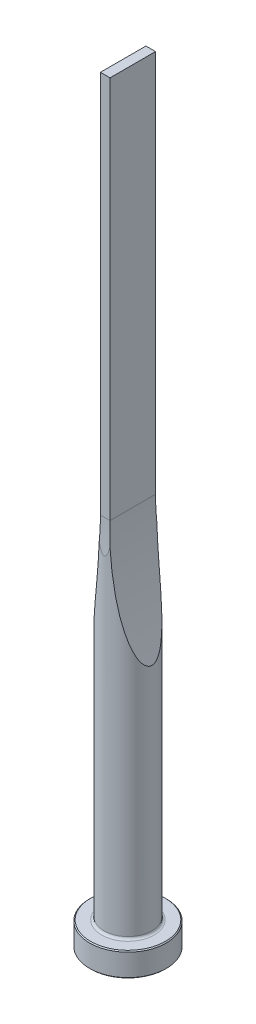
ISO-10303-21;
HEADER;
FILE_DESCRIPTION(('STEP AP214'),'2;1');
FILE_NAME('part.step','',(''),(''),'','','');
FILE_SCHEMA(('AUTOMOTIVE_DESIGN { 1 0 10303 214 1 1 1 1 }'));
ENDSEC;
DATA;
#1=APPLICATION_CONTEXT('core data for automotive mechanical design processes');
#2=APPLICATION_PROTOCOL_DEFINITION('international standard','automotive_design',2000,#1);
#3=PRODUCT_CONTEXT('',#1,'mechanical');
#4=PRODUCT('Part','Part','',(#3));
#5=PRODUCT_RELATED_PRODUCT_CATEGORY('part','',(#4));
#6=PRODUCT_DEFINITION_FORMATION('','',#4);
#7=PRODUCT_DEFINITION_CONTEXT('part definition',#1,'design');
#8=PRODUCT_DEFINITION('design','',#6,#7);
#9=PRODUCT_DEFINITION_SHAPE('','',#8);
#10=(LENGTH_UNIT() NAMED_UNIT(*) SI_UNIT(.MILLI.,.METRE.));
#11=(NAMED_UNIT(*) PLANE_ANGLE_UNIT() SI_UNIT($,.RADIAN.));
#12=(NAMED_UNIT(*) SI_UNIT($,.STERADIAN.) SOLID_ANGLE_UNIT());
#13=UNCERTAINTY_MEASURE_WITH_UNIT(LENGTH_MEASURE(1.E-05),#10,'distance_accuracy_value','');
#14=(GEOMETRIC_REPRESENTATION_CONTEXT(3) GLOBAL_UNCERTAINTY_ASSIGNED_CONTEXT((#13)) GLOBAL_UNIT_ASSIGNED_CONTEXT((#10,
#11,#12)) REPRESENTATION_CONTEXT('',''));
#15=CARTESIAN_POINT('',(0.,0.,0.));
#16=DIRECTION('',(0.,0.,1.));
#17=DIRECTION('',(1.,0.,0.));
#18=AXIS2_PLACEMENT_3D('',#15,#16,#17);
#19=CARTESIAN_POINT('',(0.,0.,0.));
#20=DIRECTION('',(0.,1.,0.));
#21=DIRECTION('',(-1.,0.,0.));
#22=AXIS2_PLACEMENT_3D('',#19,#20,#21);
#23=PLANE('',#22);
#24=CARTESIAN_POINT('',(0.,0.,0.));
#25=DIRECTION('',(0.,1.,0.));
#26=DIRECTION('',(-1.,0.,0.));
#27=AXIS2_PLACEMENT_3D('',#24,#25,#26);
#28=CIRCLE('',#27,7.8);
#29=CARTESIAN_POINT('',(-7.8,0.,0.));
#30=VERTEX_POINT('',#29);
#31=EDGE_CURVE('E133',#30,#30,#28,.T.);
#32=ORIENTED_EDGE('',*,*,#31,.F.);
#33=EDGE_LOOP('',(#32));
#34=FACE_BOUND('',#33,.T.);
#35=ADVANCED_FACE('F32',(#34),#23,.F.);
#36=CARTESIAN_POINT('',(0.,0.,0.));
#37=DIRECTION('',(0.,1.,0.));
#38=DIRECTION('',(-1.,0.,0.));
#39=AXIS2_PLACEMENT_3D('',#36,#37,#38);
#40=CONICAL_SURFACE('',#39,7.8,0.785398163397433);
#41=CARTESIAN_POINT('',(0.,0.200000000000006,0.));
#42=DIRECTION('',(0.,1.,0.));
#43=DIRECTION('',(-1.,0.,0.));
#44=AXIS2_PLACEMENT_3D('',#41,#42,#43);
#45=CIRCLE('',#44,8.);
#46=CARTESIAN_POINT('',(-8.,0.200000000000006,0.));
#47=VERTEX_POINT('',#46);
#48=EDGE_CURVE('E130',#47,#47,#45,.T.);
#49=ORIENTED_EDGE('',*,*,#48,.F.);
#50=EDGE_LOOP('',(#49));
#51=FACE_BOUND('',#50,.T.);
#52=ORIENTED_EDGE('',*,*,#31,.T.);
#53=EDGE_LOOP('',(#52));
#54=FACE_BOUND('',#53,.T.);
#55=ADVANCED_FACE('F171',(#51,#54),#40,.T.);
#56=CARTESIAN_POINT('',(0.,160.,0.));
#57=DIRECTION('',(0.,1.,0.));
#58=DIRECTION('',(-1.,0.,0.));
#59=AXIS2_PLACEMENT_3D('',#56,#57,#58);
#60=CYLINDRICAL_SURFACE('',#59,8.);
#61=CARTESIAN_POINT('',(0.,4.8,0.));
#62=DIRECTION('',(0.,1.,0.));
#63=DIRECTION('',(-1.,0.,0.));
#64=AXIS2_PLACEMENT_3D('',#61,#62,#63);
#65=CIRCLE('',#64,8.);
#66=CARTESIAN_POINT('',(-8.,4.8,0.));
#67=VERTEX_POINT('',#66);
#68=EDGE_CURVE('E127',#67,#67,#65,.T.);
#69=ORIENTED_EDGE('',*,*,#68,.F.);
#70=EDGE_LOOP('',(#69));
#71=FACE_BOUND('',#70,.T.);
#72=ORIENTED_EDGE('',*,*,#48,.T.);
#73=EDGE_LOOP('',(#72));
#74=FACE_BOUND('',#73,.T.);
#75=ADVANCED_FACE('F176',(#71,#74),#60,.T.);
#76=CARTESIAN_POINT('',(0.,4.8,0.));
#77=DIRECTION('',(0.,-1.,0.));
#78=DIRECTION('',(1.,0.,0.));
#79=AXIS2_PLACEMENT_3D('',#76,#77,#78);
#80=CONICAL_SURFACE('',#79,8.,0.785398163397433);
#81=CARTESIAN_POINT('',(0.,5.,0.));
#82=DIRECTION('',(0.,1.,0.));
#83=DIRECTION('',(-1.,0.,0.));
#84=AXIS2_PLACEMENT_3D('',#81,#82,#83);
#85=CIRCLE('',#84,7.8);
#86=CARTESIAN_POINT('',(-7.8,5.,0.));
#87=VERTEX_POINT('',#86);
#88=EDGE_CURVE('E124',#87,#87,#85,.T.);
#89=ORIENTED_EDGE('',*,*,#88,.F.);
#90=EDGE_LOOP('',(#89));
#91=FACE_BOUND('',#90,.T.);
#92=ORIENTED_EDGE('',*,*,#68,.T.);
#93=EDGE_LOOP('',(#92));
#94=FACE_BOUND('',#93,.T.);
#95=ADVANCED_FACE('F183',(#91,#94),#80,.T.);
#96=CARTESIAN_POINT('',(7.8,5.,0.));
#97=DIRECTION('',(0.,-1.,0.));
#98=DIRECTION('',(1.,0.,0.));
#99=AXIS2_PLACEMENT_3D('',#96,#97,#98);
#100=PLANE('',#99);
#101=CARTESIAN_POINT('',(0.,5.,0.));
#102=DIRECTION('',(0.,1.,0.));
#103=DIRECTION('',(-1.,0.,0.));
#104=AXIS2_PLACEMENT_3D('',#101,#102,#103);
#105=CIRCLE('',#104,5.50000000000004);
#106=CARTESIAN_POINT('',(-5.50000000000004,5.,0.));
#107=VERTEX_POINT('',#106);
#108=EDGE_CURVE('E121',#107,#107,#105,.T.);
#109=ORIENTED_EDGE('',*,*,#108,.F.);
#110=EDGE_LOOP('',(#109));
#111=FACE_BOUND('',#110,.T.);
#112=ORIENTED_EDGE('',*,*,#88,.T.);
#113=EDGE_LOOP('',(#112));
#114=FACE_BOUND('',#113,.T.);
#115=ADVANCED_FACE('F190',(#111,#114),#100,.F.);
#116=CARTESIAN_POINT('',(0.,5.5,0.));
#117=DIRECTION('',(0.,1.,0.));
#118=DIRECTION('',(-1.,0.,0.));
#119=AXIS2_PLACEMENT_3D('',#116,#117,#118);
#120=TOROIDAL_SURFACE('',#119,5.50000000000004,0.5);
#121=CARTESIAN_POINT('',(0.,5.50000000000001,0.));
#122=DIRECTION('',(0.,1.,0.));
#123=DIRECTION('',(-1.,0.,0.));
#124=AXIS2_PLACEMENT_3D('',#121,#122,#123);
#125=CIRCLE('',#124,5.00000000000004);
#126=CARTESIAN_POINT('',(-5.00000000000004,5.50000000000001,0.));
#127=VERTEX_POINT('',#126);
#128=EDGE_CURVE('E112',#127,#127,#125,.T.);
#129=ORIENTED_EDGE('',*,*,#128,.F.);
#130=EDGE_LOOP('',(#129));
#131=FACE_BOUND('',#130,.T.);
#132=ORIENTED_EDGE('',*,*,#108,.T.);
#133=EDGE_LOOP('',(#132));
#134=FACE_BOUND('',#133,.T.);
#135=ADVANCED_FACE('F168',(#131,#134),#120,.F.);
#136=CARTESIAN_POINT('',(0.,160.,0.));
#137=DIRECTION('',(0.,1.,0.));
#138=DIRECTION('',(-1.,0.,0.));
#139=AXIS2_PLACEMENT_3D('',#136,#137,#138);
#140=CYLINDRICAL_SURFACE('',#139,5.00000000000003);
#141=CARTESIAN_POINT('',(5.00000000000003,53.4670016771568,0.));
#142=CARTESIAN_POINT('',(5.00000154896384,53.4669968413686,0.0960044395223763));
#143=CARTESIAN_POINT('',(4.99720101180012,53.4760689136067,0.19199553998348));
#144=CARTESIAN_POINT('',(4.98639433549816,53.5111351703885,0.380563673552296));
#145=CARTESIAN_POINT('',(4.97838040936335,53.5371546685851,0.473135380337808));
#146=CARTESIAN_POINT('',(4.95578653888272,53.6107011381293,0.672615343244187));
#147=CARTESIAN_POINT('',(4.94013666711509,53.6617443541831,0.778078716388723));
#148=CARTESIAN_POINT('',(4.90426575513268,53.7792390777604,0.97911825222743));
#149=CARTESIAN_POINT('',(4.88403584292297,53.8457204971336,1.07467469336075));
#150=CARTESIAN_POINT('',(4.84381261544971,53.9785578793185,1.24247223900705));
#151=CARTESIAN_POINT('',(4.82425119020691,54.0433953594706,1.31604909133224));
#152=CARTESIAN_POINT('',(4.78353192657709,54.1789689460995,1.45712663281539));
#153=CARTESIAN_POINT('',(4.76237288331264,54.2497095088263,1.52462265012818));
#154=CARTESIAN_POINT('',(4.71888736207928,54.3957927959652,1.65432437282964));
#155=CARTESIAN_POINT('',(4.69655843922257,54.4711452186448,1.71651822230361));
#156=CARTESIAN_POINT('',(4.6511125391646,54.6252863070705,1.83609311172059));
#157=CARTESIAN_POINT('',(4.62799578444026,54.7040740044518,1.8934754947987));
#158=CARTESIAN_POINT('',(4.57193640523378,54.8961477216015,2.02594032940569));
#159=CARTESIAN_POINT('',(4.53873036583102,55.0107315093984,2.09902518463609));
#160=CARTESIAN_POINT('',(4.4716885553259,55.2438683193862,2.23829551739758));
#161=CARTESIAN_POINT('',(4.43785249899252,55.3624231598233,2.30447777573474));
#162=CARTESIAN_POINT('',(4.36981519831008,55.6027317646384,2.43102533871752));
#163=CARTESIAN_POINT('',(4.33561346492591,55.724490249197,2.49138136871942));
#164=CARTESIAN_POINT('',(4.26710841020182,55.970396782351,2.60696898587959));
#165=CARTESIAN_POINT('',(4.23280507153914,56.0945452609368,2.66219964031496));
#166=CARTESIAN_POINT('',(4.12966776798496,56.4710138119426,2.82170259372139));
#167=CARTESIAN_POINT('',(4.06092380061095,56.7262382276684,2.91921456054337));
#168=CARTESIAN_POINT('',(3.95867524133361,57.1127635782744,3.05484023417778));
#169=CARTESIAN_POINT('',(3.92475237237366,57.242159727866,3.09825753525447));
#170=CARTESIAN_POINT('',(3.85723820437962,57.5020650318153,3.1819194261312));
#171=CARTESIAN_POINT('',(3.82364690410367,57.632574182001,3.22216402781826));
#172=CARTESIAN_POINT('',(3.73229791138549,57.9908387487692,3.3283415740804));
#173=CARTESIAN_POINT('',(3.67493060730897,58.2195440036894,3.39140657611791));
#174=CARTESIAN_POINT('',(3.56157034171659,58.6791868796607,3.51026380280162));
#175=CARTESIAN_POINT('',(3.50557755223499,58.9101247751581,3.56605512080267));
#176=CARTESIAN_POINT('',(3.39509078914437,59.3738824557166,3.67140136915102));
#177=CARTESIAN_POINT('',(3.34059749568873,59.6067030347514,3.72095350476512));
#178=CARTESIAN_POINT('',(3.23323739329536,60.0738153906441,3.81460850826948));
#179=CARTESIAN_POINT('',(3.180370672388,60.3081072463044,3.85871108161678));
#180=CARTESIAN_POINT('',(3.0241298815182,61.0137257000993,3.98403896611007));
#181=CARTESIAN_POINT('',(2.92332782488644,61.4869034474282,4.05808782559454));
#182=CARTESIAN_POINT('',(2.72899333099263,62.4368416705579,4.19123126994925));
#183=CARTESIAN_POINT('',(2.63546167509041,62.9136025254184,4.25032424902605));
#184=CARTESIAN_POINT('',(2.5006880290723,63.6313937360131,4.33004331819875));
#185=CARTESIAN_POINT('',(2.45663062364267,63.8714118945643,4.3551563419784));
#186=CARTESIAN_POINT('',(2.37042835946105,64.3520405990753,4.40266882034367));
#187=CARTESIAN_POINT('',(2.3282833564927,64.5926510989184,4.42506847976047));
#188=CARTESIAN_POINT('',(2.20473350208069,65.3153299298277,4.48862457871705));
#189=CARTESIAN_POINT('',(2.12621903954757,65.7982177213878,4.52613511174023));
#190=CARTESIAN_POINT('',(1.97709022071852,66.7651749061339,4.59323181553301));
#191=CARTESIAN_POINT('',(1.90646690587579,67.2492423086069,4.62282702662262));
#192=CARTESIAN_POINT('',(1.77308159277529,68.218807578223,4.6756095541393));
#193=CARTESIAN_POINT('',(1.71031965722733,68.7043054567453,4.6987968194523));
#194=CARTESIAN_POINT('',(1.59289942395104,69.6748598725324,4.73988655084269));
#195=CARTESIAN_POINT('',(1.53821490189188,70.159912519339,4.75780631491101));
#196=CARTESIAN_POINT('',(1.43673211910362,71.1309879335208,4.78942837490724));
#197=CARTESIAN_POINT('',(1.3899340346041,71.6170107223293,4.80313057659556));
#198=CARTESIAN_POINT('',(1.30424463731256,72.5898756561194,4.82710313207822));
#199=CARTESIAN_POINT('',(1.26535396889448,73.0767178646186,4.83737320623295));
#200=CARTESIAN_POINT('',(1.19549959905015,74.0510290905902,4.85510840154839));
#201=CARTESIAN_POINT('',(1.1645360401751,74.5384981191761,4.86257347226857));
#202=CARTESIAN_POINT('',(1.1105247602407,75.5143299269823,4.8751931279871));
#203=CARTESIAN_POINT('',(1.08748394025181,76.0026931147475,4.8803456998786));
#204=CARTESIAN_POINT('',(1.04936282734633,76.9797496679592,4.88868116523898));
#205=CARTESIAN_POINT('',(1.0342826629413,77.4684430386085,4.8918640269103));
#206=CARTESIAN_POINT('',(1.00099348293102,78.9347439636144,4.89884013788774));
#207=CARTESIAN_POINT('',(0.994730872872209,79.9126610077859,4.90006195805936));
#208=CARTESIAN_POINT('',(1.01403027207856,81.8632780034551,4.89610457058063));
#209=CARTESIAN_POINT('',(1.03943328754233,82.8359795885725,4.89095734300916));
#210=CARTESIAN_POINT('',(1.10117659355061,84.2939764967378,4.87727389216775));
#211=CARTESIAN_POINT('',(1.12569941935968,84.7798252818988,4.8717185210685));
#212=CARTESIAN_POINT('',(1.18261689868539,85.751025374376,4.8582185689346));
#213=CARTESIAN_POINT('',(1.21501141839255,86.2363766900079,4.85027402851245));
#214=CARTESIAN_POINT('',(1.28763203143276,87.2060558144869,4.83150141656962));
#215=CARTESIAN_POINT('',(1.32785199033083,87.6903841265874,4.82067560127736));
#216=CARTESIAN_POINT('',(1.41612183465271,88.6582268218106,4.79548827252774));
#217=CARTESIAN_POINT('',(1.46417155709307,89.141741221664,4.78112683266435));
#218=CARTESIAN_POINT('',(1.56807107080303,90.1077216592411,4.74806540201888));
#219=CARTESIAN_POINT('',(1.62391986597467,90.5901878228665,4.72936596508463));
#220=CARTESIAN_POINT('',(1.74338740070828,91.5539104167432,4.68664389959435));
#221=CARTESIAN_POINT('',(1.80700584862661,92.0351668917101,4.66262147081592));
#222=CARTESIAN_POINT('',(1.91158138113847,92.779860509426,4.62033026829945));
#223=CARTESIAN_POINT('',(1.94984472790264,93.0438082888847,4.60434084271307));
#224=CARTESIAN_POINT('',(2.02869323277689,93.5712072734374,4.57014746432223));
#225=CARTESIAN_POINT('',(2.06927834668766,93.834658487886,4.55194355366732));
#226=CARTESIAN_POINT('',(2.19451193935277,94.6242725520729,4.49362155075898));
#227=CARTESIAN_POINT('',(2.28262885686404,95.1496259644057,4.44979702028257));
#228=CARTESIAN_POINT('',(2.46855242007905,96.2009126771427,4.34942322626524));
#229=CARTESIAN_POINT('',(2.56641761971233,96.7268280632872,4.29279410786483));
#230=CARTESIAN_POINT('',(2.77107152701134,97.7747263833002,4.16363596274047));
#231=CARTESIAN_POINT('',(2.87785539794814,98.2967112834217,4.09111551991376));
#232=CARTESIAN_POINT('',(3.04514240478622,99.0791888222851,3.9663566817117));
#233=CARTESIAN_POINT('',(3.1024753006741,99.3415879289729,3.92177383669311));
#234=CARTESIAN_POINT('',(3.21924275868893,99.8648051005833,3.82650860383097));
#235=CARTESIAN_POINT('',(3.27867723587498,100.125623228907,3.77582646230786));
#236=CARTESIAN_POINT('',(3.39967776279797,100.645945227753,3.66726258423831));
#237=CARTESIAN_POINT('',(3.46124851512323,100.905444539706,3.609364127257));
#238=CARTESIAN_POINT('',(3.58621745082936,101.421979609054,3.4852270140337));
#239=CARTESIAN_POINT('',(3.64961542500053,101.67901564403,3.41898930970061));
#240=CARTESIAN_POINT('',(3.7774951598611,102.187899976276,3.27713111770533));
#241=CARTESIAN_POINT('',(3.84196420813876,102.43977331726,3.20158985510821));
#242=CARTESIAN_POINT('',(3.97210146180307,102.93929985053,3.03863271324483));
#243=CARTESIAN_POINT('',(4.03776939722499,103.186953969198,2.95121947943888));
#244=CARTESIAN_POINT('',(4.16951934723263,103.675541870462,2.76195924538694));
#245=CARTESIAN_POINT('',(4.2355987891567,103.916497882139,2.66016919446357));
#246=CARTESIAN_POINT('',(4.33442118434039,104.271228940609,2.49337583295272));
#247=CARTESIAN_POINT('',(4.36729744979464,104.388303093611,2.43545657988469));
#248=CARTESIAN_POINT('',(4.4327629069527,104.61966470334,2.31416842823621));
#249=CARTESIAN_POINT('',(4.46535216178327,104.733952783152,2.25080076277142));
#250=CARTESIAN_POINT('',(4.52759848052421,104.950662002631,2.12262681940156));
#251=CARTESIAN_POINT('',(4.55729460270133,105.053336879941,2.05827093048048));
#252=CARTESIAN_POINT('',(4.61592874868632,105.254766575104,1.92318274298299));
#253=CARTESIAN_POINT('',(4.64486628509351,105.353518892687,1.85244646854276));
#254=CARTESIAN_POINT('',(4.70136067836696,105.545151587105,1.70396207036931));
#255=CARTESIAN_POINT('',(4.72892432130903,105.638061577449,1.62625514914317));
#256=CARTESIAN_POINT('',(4.78216227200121,105.816527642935,1.462309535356));
#257=CARTESIAN_POINT('',(4.80783889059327,105.902092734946,1.3760815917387));
#258=CARTESIAN_POINT('',(4.85290402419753,106.051546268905,1.20659680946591));
#259=CARTESIAN_POINT('',(4.87266804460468,106.116788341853,1.12464947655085));
#260=CARTESIAN_POINT('',(4.90919794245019,106.236953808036,0.952631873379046));
#261=CARTESIAN_POINT('',(4.92596117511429,106.291868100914,0.862554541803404));
#262=CARTESIAN_POINT('',(4.95542941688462,106.388149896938,0.673062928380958));
#263=CARTESIAN_POINT('',(4.96807762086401,106.429327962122,0.5735406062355));
#264=CARTESIAN_POINT('',(4.98749102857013,106.492441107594,0.368082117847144));
#265=CARTESIAN_POINT('',(4.99427223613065,106.514428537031,0.262164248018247));
#266=CARTESIAN_POINT('',(5.0005455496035,106.534768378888,0.0599572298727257));
#267=CARTESIAN_POINT('',(5.0007754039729,106.535512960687,-0.036065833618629));
#268=CARTESIAN_POINT('',(4.9957774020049,106.519309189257,-0.226483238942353));
#269=CARTESIAN_POINT('',(4.99054546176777,106.502347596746,-0.320876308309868));
#270=CARTESIAN_POINT('',(4.97457918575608,106.450477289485,-0.513611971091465));
#271=CARTESIAN_POINT('',(4.96337346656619,106.414030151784,-0.611490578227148));
#272=CARTESIAN_POINT('',(4.93654473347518,106.326484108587,-0.79975700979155));
#273=CARTESIAN_POINT('',(4.92091437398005,106.275360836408,-0.890132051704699));
#274=CARTESIAN_POINT('',(4.87641895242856,106.129244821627,-1.11360480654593));
#275=CARTESIAN_POINT('',(4.84515754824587,106.026074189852,-1.24080589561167));
#276=CARTESIAN_POINT('',(4.77810953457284,105.803086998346,-1.47815178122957));
#277=CARTESIAN_POINT('',(4.74231048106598,105.683224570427,-1.58824774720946));
#278=CARTESIAN_POINT('',(4.66694126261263,105.428746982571,-1.79789942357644));
#279=CARTESIAN_POINT('',(4.62728518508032,105.293773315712,-1.89698164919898));
#280=CARTESIAN_POINT('',(4.54647688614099,105.016180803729,-2.08323058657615));
#281=CARTESIAN_POINT('',(4.50532306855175,104.873553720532,-2.17038408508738));
#282=CARTESIAN_POINT('',(4.42221036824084,104.582702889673,-2.3350733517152));
#283=CARTESIAN_POINT('',(4.38024993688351,104.434467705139,-2.41258791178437));
#284=CARTESIAN_POINT('',(4.29610542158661,104.134186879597,-2.55941949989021));
#285=CARTESIAN_POINT('',(4.25392145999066,103.982143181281,-2.6287406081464));
#286=CARTESIAN_POINT('',(4.17555386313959,103.696714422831,-2.75122865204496));
#287=CARTESIAN_POINT('',(4.13936129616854,103.563714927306,-2.80529603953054));
#288=CARTESIAN_POINT('',(4.06716125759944,103.295939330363,-2.90898323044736));
#289=CARTESIAN_POINT('',(4.03115380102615,103.161163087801,-2.95860267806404));
#290=CARTESIAN_POINT('',(3.92354173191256,102.754537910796,-3.10163136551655));
#291=CARTESIAN_POINT('',(3.85237701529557,102.480500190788,-3.18916589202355));
#292=CARTESIAN_POINT('',(3.71167581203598,101.927836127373,-3.35186649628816));
#293=CARTESIAN_POINT('',(3.64214267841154,101.649202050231,-3.42700874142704));
#294=CARTESIAN_POINT('',(3.50517413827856,101.088827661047,-3.56697884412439));
#295=CARTESIAN_POINT('',(3.43773897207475,100.80708699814,-3.63180552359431));
#296=CARTESIAN_POINT('',(3.30484385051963,100.239687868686,-3.7531506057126));
#297=CARTESIAN_POINT('',(3.23939665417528,99.9540164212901,-3.80962183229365));
#298=CARTESIAN_POINT('',(3.11101855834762,99.3807438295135,-3.91515820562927));
#299=CARTESIAN_POINT('',(3.04808776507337,99.0931426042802,-3.9642230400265));
#300=CARTESIAN_POINT('',(2.92493217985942,98.5167270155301,-4.05594109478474));
#301=CARTESIAN_POINT('',(2.86470416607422,98.2279145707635,-4.09860209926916));
#302=CARTESIAN_POINT('',(2.74695256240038,97.6489910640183,-4.17843292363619));
#303=CARTESIAN_POINT('',(2.68942895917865,97.3588800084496,-4.21560277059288));
#304=CARTESIAN_POINT('',(2.53355818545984,96.5518925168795,-4.31217985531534));
#305=CARTESIAN_POINT('',(2.43818802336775,96.0338213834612,-4.36644825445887));
#306=CARTESIAN_POINT('',(2.25638863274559,94.9949854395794,-4.46310156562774));
#307=CARTESIAN_POINT('',(2.16996035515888,94.4742203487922,-4.5054852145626));
#308=CARTESIAN_POINT('',(2.00615726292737,93.430382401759,-4.58077043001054));
#309=CARTESIAN_POINT('',(1.92878603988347,92.9073087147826,-4.61366824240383));
#310=CARTESIAN_POINT('',(1.78322876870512,91.8594903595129,-4.67185522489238));
#311=CARTESIAN_POINT('',(1.71504240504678,91.3347457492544,-4.69714465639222));
#312=CARTESIAN_POINT('',(1.58778759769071,90.2828728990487,-4.74167486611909));
#313=CARTESIAN_POINT('',(1.5287369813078,89.7557420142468,-4.7609038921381));
#314=CARTESIAN_POINT('',(1.41995149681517,88.7003638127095,-4.79447345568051));
#315=CARTESIAN_POINT('',(1.37021670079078,88.1721164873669,-4.80881395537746));
#316=CARTESIAN_POINT('',(1.28009974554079,87.1148390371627,-4.83358319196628));
#317=CARTESIAN_POINT('',(1.23971576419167,86.5858090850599,-4.84401269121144));
#318=CARTESIAN_POINT('',(1.16830723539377,85.5270682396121,-4.86172917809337));
#319=CARTESIAN_POINT('',(1.13728265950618,84.997357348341,-4.86901617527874));
#320=CARTESIAN_POINT('',(1.08466989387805,83.9387300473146,-4.88100571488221));
#321=CARTESIAN_POINT('',(1.06305894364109,83.4098148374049,-4.88571449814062));
#322=CARTESIAN_POINT('',(1.02917222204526,82.3516704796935,-4.89296479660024));
#323=CARTESIAN_POINT('',(1.01689645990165,81.8224413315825,-4.89550630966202));
#324=CARTESIAN_POINT('',(1.0016841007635,80.7638023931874,-4.89864156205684));
#325=CARTESIAN_POINT('',(0.99874822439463,80.2343925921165,-4.89923515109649));
#326=CARTESIAN_POINT('',(1.00221872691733,79.1756061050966,-4.89852639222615));
#327=CARTESIAN_POINT('',(1.00862508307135,78.6462294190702,-4.89722404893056));
#328=CARTESIAN_POINT('',(1.03076533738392,77.5882692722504,-4.89261183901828));
#329=CARTESIAN_POINT('',(1.04648884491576,77.0596855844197,-4.88930420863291));
#330=CARTESIAN_POINT('',(1.08724906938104,76.0028967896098,-4.88040215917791));
#331=CARTESIAN_POINT('',(1.11228577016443,75.4746916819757,-4.8748077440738));
#332=CARTESIAN_POINT('',(1.17165876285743,74.4189040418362,-4.86087905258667));
#333=CARTESIAN_POINT('',(1.20599394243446,73.8913214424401,-4.85254510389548));
#334=CARTESIAN_POINT('',(1.28394960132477,72.8369178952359,-4.83250425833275));
#335=CARTESIAN_POINT('',(1.32756979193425,72.3100969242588,-4.82079746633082));
#336=CARTESIAN_POINT('',(1.39938046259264,71.5267726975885,-4.80024265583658));
#337=CARTESIAN_POINT('',(1.42404381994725,71.2698994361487,-4.79299742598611));
#338=CARTESIAN_POINT('',(1.47557483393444,70.7564141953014,-4.77738457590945));
#339=CARTESIAN_POINT('',(1.50244244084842,70.4998022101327,-4.76901698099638));
#340=CARTESIAN_POINT('',(1.58634730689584,69.7303876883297,-4.74204261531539));
#341=CARTESIAN_POINT('',(1.64668680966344,69.2180044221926,-4.72156420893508));
#342=CARTESIAN_POINT('',(1.77608600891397,68.1949653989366,-4.67442569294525));
#343=CARTESIAN_POINT('',(1.84513998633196,67.6843087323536,-4.6477696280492));
#344=CARTESIAN_POINT('',(1.99193759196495,66.6647054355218,-4.5867761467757));
#345=CARTESIAN_POINT('',(2.06968099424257,66.1557587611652,-4.55243893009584));
#346=CARTESIAN_POINT('',(2.20798798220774,65.2995540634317,-4.48649769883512));
#347=CARTESIAN_POINT('',(2.26627559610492,64.9517320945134,-4.45742409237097));
#348=CARTESIAN_POINT('',(2.38684958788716,64.257262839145,-4.39404053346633));
#349=CARTESIAN_POINT('',(2.44913588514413,63.910615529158,-4.35973068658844));
#350=CARTESIAN_POINT('',(2.57765345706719,63.2186876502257,-4.28500117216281));
#351=CARTESIAN_POINT('',(2.64388492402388,62.8734071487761,-4.24458120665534));
#352=CARTESIAN_POINT('',(2.78020235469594,62.1845401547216,-4.15656616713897));
#353=CARTESIAN_POINT('',(2.85028819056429,61.8409536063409,-4.10897133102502));
#354=CARTESIAN_POINT('',(3.02204202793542,61.0233200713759,-3.98528420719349));
#355=CARTESIAN_POINT('',(3.12544238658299,60.5502031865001,-3.90528915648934));
#356=CARTESIAN_POINT('',(3.28556951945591,59.844680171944,-3.76959949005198));
#357=CARTESIAN_POINT('',(3.33978638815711,59.6101839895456,-3.72175008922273));
#358=CARTESIAN_POINT('',(3.44979842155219,59.1428717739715,-3.62001659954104));
#359=CARTESIAN_POINT('',(3.50559354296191,58.9100556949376,-3.56613267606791));
#360=CARTESIAN_POINT('',(3.61627256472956,58.45617382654,-3.45377007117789));
#361=CARTESIAN_POINT('',(3.67109727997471,58.235023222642,-3.39557708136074));
#362=CARTESIAN_POINT('',(3.78191185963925,57.7951236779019,-3.27170533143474));
#363=CARTESIAN_POINT('',(3.83790164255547,57.5763745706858,-3.20602709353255));
#364=CARTESIAN_POINT('',(3.95085857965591,57.1417975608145,-3.06575209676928));
#365=CARTESIAN_POINT('',(4.00782644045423,56.9259719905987,-2.99114863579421));
#366=CARTESIAN_POINT('',(4.12234036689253,56.4984860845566,-2.83125530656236));
#367=CARTESIAN_POINT('',(4.17988625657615,56.2868245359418,-2.74596860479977));
#368=CARTESIAN_POINT('',(4.27415528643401,55.9449180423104,-2.59544961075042));
#369=CARTESIAN_POINT('',(4.31087254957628,55.8129464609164,-2.53413927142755));
#370=CARTESIAN_POINT('',(4.38408949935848,55.5520474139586,-2.40525694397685));
#371=CARTESIAN_POINT('',(4.42058923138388,55.4231192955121,-2.33768631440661));
#372=CARTESIAN_POINT('',(4.49299970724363,55.1694490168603,-2.19529639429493));
#373=CARTESIAN_POINT('',(4.5289113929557,55.0446997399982,-2.12049036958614));
#374=CARTESIAN_POINT('',(4.5997265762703,54.8006176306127,-1.96215201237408));
#375=CARTESIAN_POINT('',(4.63463070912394,54.6812813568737,-1.87862533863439));
#376=CARTESIAN_POINT('',(4.7023042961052,54.4515780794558,-1.70210724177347));
#377=CARTESIAN_POINT('',(4.73509500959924,54.3411174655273,-1.60924745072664));
#378=CARTESIAN_POINT('',(4.79790106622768,54.1309041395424,-1.41101509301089));
#379=CARTESIAN_POINT('',(4.82791715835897,54.0311485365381,-1.30564592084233));
#380=CARTESIAN_POINT('',(4.87770376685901,53.8665741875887,-1.10298058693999));
#381=CARTESIAN_POINT('',(4.89831887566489,53.7987693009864,-1.00835750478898));
#382=CARTESIAN_POINT('',(4.9351315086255,53.6781006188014,-0.809128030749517));
#383=CARTESIAN_POINT('',(4.95133579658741,53.625213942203,-0.704537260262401));
#384=CARTESIAN_POINT('',(4.97573891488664,53.5457371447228,-0.501038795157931));
#385=CARTESIAN_POINT('',(4.98472133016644,53.5165669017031,-0.403258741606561));
#386=CARTESIAN_POINT('',(4.99684527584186,53.4772205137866,-0.203641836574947));
#387=CARTESIAN_POINT('',(4.99999835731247,53.4670068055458,-0.101813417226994));
#388=CARTESIAN_POINT('',(5.00000000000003,53.4670016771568,0.));
#389=B_SPLINE_CURVE_WITH_KNOTS('',3,(#141,#142,#143,#144,#145,#146,#147,#148,#149,#150,#151,
#152,#153,#154,#155,#156,#157,#158,#159,#160,#161,#162,#163,#164,#165,#166,#167,#168,#169,#170,
#171,#172,#173,#174,#175,#176,#177,#178,#179,#180,#181,#182,#183,#184,#185,#186,#187,#188,#189,
#190,#191,#192,#193,#194,#195,#196,#197,#198,#199,#200,#201,#202,#203,#204,#205,#206,#207,#208,
#209,#210,#211,#212,#213,#214,#215,#216,#217,#218,#219,#220,#221,#222,#223,#224,#225,#226,#227,
#228,#229,#230,#231,#232,#233,#234,#235,#236,#237,#238,#239,#240,#241,#242,#243,#244,#245,#246,
#247,#248,#249,#250,#251,#252,#253,#254,#255,#256,#257,#258,#259,#260,#261,#262,#263,#264,#265,
#266,#267,#268,#269,#270,#271,#272,#273,#274,#275,#276,#277,#278,#279,#280,#281,#282,#283,#284,
#285,#286,#287,#288,#289,#290,#291,#292,#293,#294,#295,#296,#297,#298,#299,#300,#301,#302,#303,
#304,#305,#306,#307,#308,#309,#310,#311,#312,#313,#314,#315,#316,#317,#318,#319,#320,#321,#322,
#323,#324,#325,#326,#327,#328,#329,#330,#331,#332,#333,#334,#335,#336,#337,#338,#339,#340,#341,
#342,#343,#344,#345,#346,#347,#348,#349,#350,#351,#352,#353,#354,#355,#356,#357,#358,#359,#360,
#361,#362,#363,#364,#365,#366,#367,#368,#369,#370,#371,#372,#373,#374,#375,#376,#377,#378,#379,
#380,#381,#382,#383,#384,#385,#386,#387,#388),.UNSPECIFIED.,.T.,.F.,(4,2,2,2,2,2,2,2,2,2,2,2,2,
2,2,2,2,2,2,2,2,2,2,2,2,2,2,2,2,2,2,2,2,2,2,2,2,2,2,2,2,2,2,2,2,2,2,2,2,2,2,2,2,2,2,2,2,2,2,2,2,
2,2,2,2,2,2,2,2,2,2,2,2,2,2,2,2,2,2,2,2,2,2,2,2,2,2,2,2,2,2,2,2,2,2,2,2,2,2,2,2,2,2,2,2,2,2,2,2,
2,2,2,2,2,2,2,2,2,2,2,2,2,2,4),(0.,0.287558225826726,0.575546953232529,0.928165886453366,
1.28147381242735,1.58105140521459,1.88085723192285,2.18131675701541,2.48169212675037,
2.90110645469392,3.32071552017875,3.74098190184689,4.16132461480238,5.00588787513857,
5.42778120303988,5.84967295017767,6.5817525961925,7.31392340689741,8.04642102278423,
8.77895821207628,10.2468428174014,11.7148849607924,12.450815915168,13.1866912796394,
14.6585275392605,16.1286755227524,17.5988352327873,19.0641117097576,20.5294209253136,
21.9948495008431,23.4603044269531,24.9270326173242,26.3937844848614,29.3270218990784,
32.2455906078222,33.7050297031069,35.1644439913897,36.6227188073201,38.0809632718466,
39.5390216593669,40.9970253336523,41.79856441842,42.6000882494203,44.2033477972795,
45.8168961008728,47.4295749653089,48.2463041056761,49.063000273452,49.8816252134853,
50.7001567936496,51.5121461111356,52.3239547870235,53.1326335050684,53.5366009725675,
53.9404772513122,54.3145814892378,54.6889204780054,55.0611767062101,55.4329692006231,
55.7520934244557,56.0714975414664,56.3951401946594,56.7178972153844,57.0041451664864,
57.2906073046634,57.6040214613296,57.9179590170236,58.4153545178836,58.9141448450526,
59.4295563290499,59.9455341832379,60.4626279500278,60.9794631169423,61.4235602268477,
61.8676928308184,62.7563186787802,63.6466340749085,64.5370510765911,65.4323179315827,
66.3276225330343,67.2218298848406,68.1160328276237,69.7044464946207,71.2930289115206,
72.8822391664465,74.4713948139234,76.0636134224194,77.6558443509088,79.2477647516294,
80.8396803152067,82.4277252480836,84.015771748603,85.6039407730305,87.1921059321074,
88.7785032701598,90.3648978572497,91.9511027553,93.537258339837,94.3117167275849,
95.0861576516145,96.6350329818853,98.1828970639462,99.7307209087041,100.79227157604,
101.853800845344,102.9153818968,103.976927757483,105.448975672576,106.185087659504,
106.921179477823,107.626544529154,108.331860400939,109.037709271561,109.743349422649,
110.193457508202,110.643468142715,111.092668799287,111.541579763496,111.984868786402,
112.428037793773,112.78163087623,113.134678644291,113.440242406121,113.74520002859),.UNSPECIFIED.);
#390=CARTESIAN_POINT('',(1.12239470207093,75.3078719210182,-4.87239470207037));
#391=VERTEX_POINT('',#390);
#392=CARTESIAN_POINT('',(1.12239470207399,75.3078719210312,4.87239470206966));
#393=VERTEX_POINT('',#392);
#394=EDGE_CURVE('E138',#391,#393,#389,.T.);
#395=ORIENTED_EDGE('',*,*,#394,.T.);
#396=CARTESIAN_POINT('',(-1.56124949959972,80.,4.74999999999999));
#397=CARTESIAN_POINT('',(-1.56124909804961,80.2802750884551,4.74999999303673));
#398=CARTESIAN_POINT('',(-1.55728190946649,80.5605493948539,4.75130959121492));
#399=CARTESIAN_POINT('',(-1.54122236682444,81.1208392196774,4.75654354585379));
#400=CARTESIAN_POINT('',(-1.52913016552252,81.4008547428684,4.76046785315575));
#401=CARTESIAN_POINT('',(-1.49622334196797,81.9601583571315,4.77091379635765));
#402=CARTESIAN_POINT('',(-1.47541419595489,82.2394467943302,4.77743380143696));
#403=CARTESIAN_POINT('',(-1.42390023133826,82.7969938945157,4.79304036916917));
#404=CARTESIAN_POINT('',(-1.39319740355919,83.0752527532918,4.80212641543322));
#405=CARTESIAN_POINT('',(-1.32163854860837,83.6165146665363,4.82230425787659));
#406=CARTESIAN_POINT('',(-1.28135596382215,83.8795951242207,4.83327546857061));
#407=CARTESIAN_POINT('',(-1.21025315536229,84.2725945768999,4.85137807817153));
#408=CARTESIAN_POINT('',(-1.18472794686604,84.4035113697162,4.85769686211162));
#409=CARTESIAN_POINT('',(-1.1294140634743,84.6643938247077,4.87085630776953));
#410=CARTESIAN_POINT('',(-1.09962649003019,84.7943597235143,4.87769683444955));
#411=CARTESIAN_POINT('',(-1.0402807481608,85.0309933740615,4.89066177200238));
#412=CARTESIAN_POINT('',(-1.01154252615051,85.1378698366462,4.89671054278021));
#413=CARTESIAN_POINT('',(-0.949556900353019,85.3502837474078,4.90910859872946));
#414=CARTESIAN_POINT('',(-0.916310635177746,85.4558215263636,4.91545780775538));
#415=CARTESIAN_POINT('',(-0.844084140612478,85.6644737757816,4.92837326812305));
#416=CARTESIAN_POINT('',(-0.805125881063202,85.7675958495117,4.9349386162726));
#417=CARTESIAN_POINT('',(-0.719242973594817,85.9704088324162,4.94819344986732));
#418=CARTESIAN_POINT('',(-0.672333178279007,86.0701057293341,4.95488268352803));
#419=CARTESIAN_POINT('',(-0.590193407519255,86.2193142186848,4.96512953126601));
#420=CARTESIAN_POINT('',(-0.559251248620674,86.2711628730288,4.96873759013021));
#421=CARTESIAN_POINT('',(-0.492379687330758,86.3716347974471,4.97581229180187));
#422=CARTESIAN_POINT('',(-0.456453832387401,86.420260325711,4.97927903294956));
#423=CARTESIAN_POINT('',(-0.392115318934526,86.4950115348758,4.98466324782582));
#424=CARTESIAN_POINT('',(-0.365747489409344,86.5228708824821,4.98668429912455));
#425=CARTESIAN_POINT('',(-0.30958860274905,86.574972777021,4.99048569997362));
#426=CARTESIAN_POINT('',(-0.279803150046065,86.5992210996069,4.99226643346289));
#427=CARTESIAN_POINT('',(-0.226668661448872,86.6349951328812,4.9949051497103));
#428=CARTESIAN_POINT('',(-0.20439457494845,86.648089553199,4.99587455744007));
#429=CARTESIAN_POINT('',(-0.158090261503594,86.6707180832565,4.99755352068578));
#430=CARTESIAN_POINT('',(-0.134063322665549,86.6802586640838,4.99826354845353));
#431=CARTESIAN_POINT('',(-0.0886514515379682,86.693589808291,4.99925686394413));
#432=CARTESIAN_POINT('',(-0.0674708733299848,86.6980624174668,4.99959071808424));
#433=CARTESIAN_POINT('',(-0.0246551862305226,86.703342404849,4.99998491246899));
#434=CARTESIAN_POINT('',(-0.00302040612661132,86.704152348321,5.00004544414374));
#435=CARTESIAN_POINT('',(0.0400515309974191,86.7020173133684,4.99988599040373));
#436=CARTESIAN_POINT('',(0.061488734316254,86.6990732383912,4.99966607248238));
#437=CARTESIAN_POINT('',(0.103598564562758,86.6897563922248,4.99897114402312));
#438=CARTESIAN_POINT('',(0.124270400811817,86.6833801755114,4.9984958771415));
#439=CARTESIAN_POINT('',(0.172649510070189,86.6645914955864,4.99709843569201));
#440=CARTESIAN_POINT('',(0.199804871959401,86.6507792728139,4.99607315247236));
#441=CARTESIAN_POINT('',(0.251622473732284,86.6191137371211,4.99373231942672));
#442=CARTESIAN_POINT('',(0.276277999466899,86.6012499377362,4.99241601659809));
#443=CARTESIAN_POINT('',(0.342266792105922,86.5472238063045,4.98845446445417));
#444=CARTESIAN_POINT('',(0.380989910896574,86.507933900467,4.98559441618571));
#445=CARTESIAN_POINT('',(0.452759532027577,86.4245560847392,4.97958806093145));
#446=CARTESIAN_POINT('',(0.485787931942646,86.3804535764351,4.97644088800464));
#447=CARTESIAN_POINT('',(0.565503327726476,86.2631216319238,4.96816187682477));
#448=CARTESIAN_POINT('',(0.609051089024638,86.1877904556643,4.96293429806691));
#449=CARTESIAN_POINT('',(0.689220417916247,86.0334769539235,4.95243210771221));
#450=CARTESIAN_POINT('',(0.725825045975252,85.954486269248,4.94715741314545));
#451=CARTESIAN_POINT('',(0.794127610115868,85.7939215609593,4.93665480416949));
#452=CARTESIAN_POINT('',(0.82579803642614,85.7123359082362,4.93142729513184));
#453=CARTESIAN_POINT('',(0.885154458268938,85.5478544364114,4.9211176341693));
#454=CARTESIAN_POINT('',(0.912845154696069,85.4649602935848,4.91603531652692));
#455=CARTESIAN_POINT('',(0.991561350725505,85.2138004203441,4.90099061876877));
#456=CARTESIAN_POINT('',(1.03784195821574,85.0440353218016,4.89129471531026));
#457=CARTESIAN_POINT('',(1.12160376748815,84.7022725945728,4.87276151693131));
#458=CARTESIAN_POINT('',(1.15907938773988,84.530273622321,4.86392476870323));
#459=CARTESIAN_POINT('',(1.22728467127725,84.1845296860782,4.84716510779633));
#460=CARTESIAN_POINT('',(1.25799984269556,84.0107817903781,4.83924417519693));
#461=CARTESIAN_POINT('',(1.31385289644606,83.6623426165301,4.82437696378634));
#462=CARTESIAN_POINT('',(1.3389900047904,83.4876512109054,4.81743082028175));
#463=CARTESIAN_POINT('',(1.4073415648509,82.9625764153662,4.79809189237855));
#464=CARTESIAN_POINT('',(1.44349272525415,82.6112114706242,4.78719953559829));
#465=CARTESIAN_POINT('',(1.5008039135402,81.9076523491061,4.76953198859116));
#466=CARTESIAN_POINT('',(1.52198194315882,81.5554596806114,4.76275185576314));
#467=CARTESIAN_POINT('',(1.55100340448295,80.8543409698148,4.75337976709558));
#468=CARTESIAN_POINT('',(1.55899037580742,80.5054214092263,4.75074274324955));
#469=CARTESIAN_POINT('',(1.56268162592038,79.8073741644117,4.74952903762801));
#470=CARTESIAN_POINT('',(1.55838094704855,79.4582464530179,4.7509539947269));
#471=CARTESIAN_POINT('',(1.53718974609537,78.7610124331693,4.75785466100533));
#472=CARTESIAN_POINT('',(1.52032131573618,78.4129054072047,4.76332326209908));
#473=CARTESIAN_POINT('',(1.472675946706,77.7178321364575,4.77826818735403));
#474=CARTESIAN_POINT('',(1.441903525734,77.3708655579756,4.78774320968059));
#475=CARTESIAN_POINT('',(1.36365394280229,76.6788269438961,4.8106341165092));
#476=CARTESIAN_POINT('',(1.31617630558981,76.3337549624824,4.82405011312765));
#477=CARTESIAN_POINT('',(1.2278246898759,75.8192451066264,4.8469922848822));
#478=CARTESIAN_POINT('',(1.1955231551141,75.6482783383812,4.85510823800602));
#479=CARTESIAN_POINT('',(1.12372438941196,75.3079534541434,4.87222905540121));
#480=CARTESIAN_POINT('',(1.08422969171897,75.1385947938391,4.88123360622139));
#481=CARTESIAN_POINT('',(0.995702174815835,74.8020881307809,4.90006914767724));
#482=CARTESIAN_POINT('',(0.946657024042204,74.6349432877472,4.90990119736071));
#483=CARTESIAN_POINT('',(0.862537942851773,74.38769004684,4.9251212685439));
#484=CARTESIAN_POINT('',(0.832712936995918,74.3057885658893,4.93027740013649));
#485=CARTESIAN_POINT('',(0.768517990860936,74.1438098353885,4.94069314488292));
#486=CARTESIAN_POINT('',(0.734150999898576,74.0637314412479,4.94595268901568));
#487=CARTESIAN_POINT('',(0.659074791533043,73.9059985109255,4.95651780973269));
#488=CARTESIAN_POINT('',(0.618328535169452,73.8283615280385,4.96182347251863));
#489=CARTESIAN_POINT('',(0.528037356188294,73.6784981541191,4.97225145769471));
#490=CARTESIAN_POINT('',(0.478541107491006,73.6062448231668,4.97737461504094));
#491=CARTESIAN_POINT('',(0.401827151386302,73.5160227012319,4.98386702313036));
#492=CARTESIAN_POINT('',(0.380686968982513,73.4929646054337,4.98553608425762));
#493=CARTESIAN_POINT('',(0.336184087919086,73.4489774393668,4.98873561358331));
#494=CARTESIAN_POINT('',(0.312817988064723,73.428051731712,4.9902658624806));
#495=CARTESIAN_POINT('',(0.263265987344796,73.3890935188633,4.99312671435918));
#496=CARTESIAN_POINT('',(0.237049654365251,73.3710986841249,4.99445470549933));
#497=CARTESIAN_POINT('',(0.181897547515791,73.33988275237,4.99676560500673));
#498=CARTESIAN_POINT('',(0.152971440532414,73.3266454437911,4.99774968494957));
#499=CARTESIAN_POINT('',(0.10229806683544,73.3099073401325,4.99899606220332));
#500=CARTESIAN_POINT('',(0.0811370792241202,73.3046559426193,4.99938786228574));
#501=CARTESIAN_POINT('',(0.038230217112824,73.2977984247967,4.99989968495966));
#502=CARTESIAN_POINT('',(0.0164849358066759,73.2961887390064,5.00001997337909));
#503=CARTESIAN_POINT('',(-0.0269727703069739,73.2967972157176,4.99997452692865));
#504=CARTESIAN_POINT('',(-0.0486851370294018,73.2990193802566,4.99980849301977));
#505=CARTESIAN_POINT('',(-0.0914351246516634,73.307043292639,4.99920977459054));
#506=CARTESIAN_POINT('',(-0.112472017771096,73.3128487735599,4.998776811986));
#507=CARTESIAN_POINT('',(-0.160507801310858,73.3300165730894,4.99749910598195));
#508=CARTESIAN_POINT('',(-0.187061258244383,73.3426047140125,4.99656385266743));
#509=CARTESIAN_POINT('',(-0.237848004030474,73.3717782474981,4.99440467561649));
#510=CARTESIAN_POINT('',(-0.262075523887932,73.3883732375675,4.99318005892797));
#511=CARTESIAN_POINT('',(-0.325987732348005,73.438060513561,4.98953016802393));
#512=CARTESIAN_POINT('',(-0.363355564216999,73.4740766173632,4.98690191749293));
#513=CARTESIAN_POINT('',(-0.432792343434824,73.5508213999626,4.98135512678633));
#514=CARTESIAN_POINT('',(-0.464844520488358,73.5915643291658,4.9784357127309));
#515=CARTESIAN_POINT('',(-0.540982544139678,73.6983286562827,4.97086484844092));
#516=CARTESIAN_POINT('',(-0.582371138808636,73.766244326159,4.96611994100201));
#517=CARTESIAN_POINT('',(-0.658822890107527,73.9055932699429,4.95655294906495));
#518=CARTESIAN_POINT('',(-0.693870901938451,73.9770344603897,4.95173070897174));
#519=CARTESIAN_POINT('',(-0.759457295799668,74.1224166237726,4.94209752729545));
#520=CARTESIAN_POINT('',(-0.789969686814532,74.1963692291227,4.93728679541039));
#521=CARTESIAN_POINT('',(-0.847303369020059,74.345575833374,4.92776956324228));
#522=CARTESIAN_POINT('',(-0.874128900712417,74.4208282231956,4.92306294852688));
#523=CARTESIAN_POINT('',(-0.949689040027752,74.6463197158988,4.90924878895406));
#524=CARTESIAN_POINT('',(-0.994217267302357,74.7979765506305,4.90033504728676));
#525=CARTESIAN_POINT('',(-1.0753372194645,75.1034617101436,4.88316862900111));
#526=CARTESIAN_POINT('',(-1.11192387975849,75.2572913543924,4.87491637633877));
#527=CARTESIAN_POINT('',(-1.17902124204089,75.5666373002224,4.85912545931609));
#528=CARTESIAN_POINT('',(-1.2095189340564,75.7221564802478,4.85158834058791));
#529=CARTESIAN_POINT('',(-1.26550324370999,76.0341365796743,4.83728492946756));
#530=CARTESIAN_POINT('',(-1.29098915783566,76.1905976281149,4.83051874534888));
#531=CARTESIAN_POINT('',(-1.36110123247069,76.6607309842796,4.81142337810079));
#532=CARTESIAN_POINT('',(-1.39943115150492,76.975395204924,4.80028500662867));
#533=CARTESIAN_POINT('',(-1.46294686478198,77.6057174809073,4.78130109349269));
#534=CARTESIAN_POINT('',(-1.48814772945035,77.9213739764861,4.7734517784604));
#535=CARTESIAN_POINT('',(-1.52589501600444,78.5308764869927,4.76151277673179));
#536=CARTESIAN_POINT('',(-1.53921639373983,78.8246708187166,4.75719469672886));
#537=CARTESIAN_POINT('',(-1.55689016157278,79.4123105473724,4.75143949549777));
#538=CARTESIAN_POINT('',(-1.56124992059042,79.7061557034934,4.75000000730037));
#539=CARTESIAN_POINT('',(-1.56124949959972,80.,4.74999999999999));
#540=B_SPLINE_CURVE_WITH_KNOTS('',3,(#396,#397,#398,#399,#400,#401,#402,#403,#404,#405,#406,
#407,#408,#409,#410,#411,#412,#413,#414,#415,#416,#417,#418,#419,#420,#421,#422,#423,#424,#425,
#426,#427,#428,#429,#430,#431,#432,#433,#434,#435,#436,#437,#438,#439,#440,#441,#442,#443,#444,
#445,#446,#447,#448,#449,#450,#451,#452,#453,#454,#455,#456,#457,#458,#459,#460,#461,#462,#463,
#464,#465,#466,#467,#468,#469,#470,#471,#472,#473,#474,#475,#476,#477,#478,#479,#480,#481,#482,
#483,#484,#485,#486,#487,#488,#489,#490,#491,#492,#493,#494,#495,#496,#497,#498,#499,#500,#501,
#502,#503,#504,#505,#506,#507,#508,#509,#510,#511,#512,#513,#514,#515,#516,#517,#518,#519,#520,
#521,#522,#523,#524,#525,#526,#527,#528,#529,#530,#531,#532,#533,#534,#535,#536,#537,#538,#539),
.UNSPECIFIED.,.T.,.F.,(4,2,2,2,2,2,2,2,2,2,2,2,2,2,2,2,2,2,2,2,2,2,2,2,2,2,2,2,2,2,2,2,2,2,2,2,
2,2,2,2,2,2,2,2,2,2,2,2,2,2,2,2,2,2,2,2,2,2,2,2,2,2,2,2,2,2,2,2,2,2,2,4),(0.,0.840791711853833,
1.68156761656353,2.52181611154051,3.36189563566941,4.16066974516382,4.56121101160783,
4.96164895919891,5.29408999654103,5.62644722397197,5.9575581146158,6.28805720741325,
6.46935117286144,6.65051674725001,6.7655479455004,6.8803931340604,6.95773039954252,
7.0349261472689,7.09958926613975,7.16420708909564,7.22880936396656,7.29347661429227,
7.38440430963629,7.47557008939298,7.64035473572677,7.8056539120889,8.06649360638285,
8.32796172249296,8.59083911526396,8.85340339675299,9.38168636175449,9.91030331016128,
10.4400426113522,10.9698553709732,12.0295389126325,13.0879462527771,14.1347586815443,
15.1819935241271,16.2273918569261,17.2724507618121,18.3175394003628,18.8399593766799,
19.3621957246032,19.8851109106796,20.1469677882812,20.4086554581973,20.6719230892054,
20.9337698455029,21.0276393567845,21.1216546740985,21.2167964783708,21.3116109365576,
21.3767537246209,21.4418327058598,21.5069796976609,21.5721946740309,21.6598966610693,
21.7478108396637,21.9028287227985,22.0583267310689,22.2967439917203,22.5357234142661,
22.7760234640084,23.0160447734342,23.4906125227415,23.9654820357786,24.4413555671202,
24.9172958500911,25.8684364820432,26.8184829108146,27.7007063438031,28.5822040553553),.UNSPECIFIED.);
#541=CARTESIAN_POINT('',(-1.12239470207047,75.3078719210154,4.87239470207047));
#542=VERTEX_POINT('',#541);
#543=EDGE_CURVE('E104',#393,#542,#540,.T.);
#544=ORIENTED_EDGE('',*,*,#543,.T.);
#545=CARTESIAN_POINT('',(-5.00000000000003,53.4670016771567,0.));
#546=CARTESIAN_POINT('',(-5.00000154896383,53.4669968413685,-0.09600443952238));
#547=CARTESIAN_POINT('',(-4.99720101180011,53.4760689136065,-0.191995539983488));
#548=CARTESIAN_POINT('',(-4.98639433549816,53.5111351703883,-0.380563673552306));
#549=CARTESIAN_POINT('',(-4.97838040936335,53.5371546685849,-0.473135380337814));
#550=CARTESIAN_POINT('',(-4.95578653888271,53.6107011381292,-0.672615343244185));
#551=CARTESIAN_POINT('',(-4.94013666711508,53.661744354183,-0.778078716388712));
#552=CARTESIAN_POINT('',(-4.90426575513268,53.7792390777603,-0.979118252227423));
#553=CARTESIAN_POINT('',(-4.88403584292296,53.8457204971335,-1.07467469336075));
#554=CARTESIAN_POINT('',(-4.8438126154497,53.9785578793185,-1.24247223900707));
#555=CARTESIAN_POINT('',(-4.8242511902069,54.0433953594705,-1.31604909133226));
#556=CARTESIAN_POINT('',(-4.78353192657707,54.1789689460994,-1.45712663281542));
#557=CARTESIAN_POINT('',(-4.76237288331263,54.2497095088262,-1.52462265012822));
#558=CARTESIAN_POINT('',(-4.71888736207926,54.3957927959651,-1.65432437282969));
#559=CARTESIAN_POINT('',(-4.69655843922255,54.4711452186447,-1.71651822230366));
#560=CARTESIAN_POINT('',(-4.65111253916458,54.6252863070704,-1.83609311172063));
#561=CARTESIAN_POINT('',(-4.62799578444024,54.7040740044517,-1.89347549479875));
#562=CARTESIAN_POINT('',(-4.57193640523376,54.8961477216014,-2.02594032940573));
#563=CARTESIAN_POINT('',(-4.538730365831,55.0107315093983,-2.09902518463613));
#564=CARTESIAN_POINT('',(-4.47168855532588,55.2438683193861,-2.2382955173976));
#565=CARTESIAN_POINT('',(-4.43785249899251,55.3624231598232,-2.30447777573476));
#566=CARTESIAN_POINT('',(-4.36981519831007,55.6027317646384,-2.43102533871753));
#567=CARTESIAN_POINT('',(-4.3356134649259,55.7244902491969,-2.49138136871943));
#568=CARTESIAN_POINT('',(-4.2671084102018,55.970396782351,-2.60696898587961));
#569=CARTESIAN_POINT('',(-4.23280507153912,56.0945452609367,-2.66219964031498));
#570=CARTESIAN_POINT('',(-4.12966776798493,56.4710138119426,-2.82170259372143));
#571=CARTESIAN_POINT('',(-4.06092380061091,56.7262382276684,-2.91921456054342));
#572=CARTESIAN_POINT('',(-3.95867524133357,57.1127635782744,-3.05484023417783));
#573=CARTESIAN_POINT('',(-3.92475237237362,57.242159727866,-3.09825753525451));
#574=CARTESIAN_POINT('',(-3.85723820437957,57.5020650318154,-3.18191942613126));
#575=CARTESIAN_POINT('',(-3.82364690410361,57.6325741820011,-3.22216402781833));
#576=CARTESIAN_POINT('',(-3.73229791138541,57.9908387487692,-3.32834157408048));
#577=CARTESIAN_POINT('',(-3.6749306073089,58.2195440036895,-3.39140657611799));
#578=CARTESIAN_POINT('',(-3.56157034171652,58.6791868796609,-3.51026380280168));
#579=CARTESIAN_POINT('',(-3.50557755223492,58.9101247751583,-3.56605512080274));
#580=CARTESIAN_POINT('',(-3.39509078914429,59.3738824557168,-3.67140136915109));
#581=CARTESIAN_POINT('',(-3.34059749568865,59.6067030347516,-3.72095350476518));
#582=CARTESIAN_POINT('',(-3.23323739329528,60.0738153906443,-3.81460850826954));
#583=CARTESIAN_POINT('',(-3.18037067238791,60.3081072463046,-3.85871108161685));
#584=CARTESIAN_POINT('',(-3.02412988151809,61.0137257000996,-3.98403896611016));
#585=CARTESIAN_POINT('',(-2.92332782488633,61.4869034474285,-4.05808782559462));
#586=CARTESIAN_POINT('',(-2.72899333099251,62.4368416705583,-4.19123126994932));
#587=CARTESIAN_POINT('',(-2.63546167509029,62.9136025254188,-4.25032424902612));
#588=CARTESIAN_POINT('',(-2.50068802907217,63.6313937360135,-4.33004331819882));
#589=CARTESIAN_POINT('',(-2.45663062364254,63.8714118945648,-4.35515634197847));
#590=CARTESIAN_POINT('',(-2.37042835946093,64.3520405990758,-4.40266882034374));
#591=CARTESIAN_POINT('',(-2.32828335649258,64.5926510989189,-4.42506847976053));
#592=CARTESIAN_POINT('',(-2.20473350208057,65.3153299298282,-4.48862457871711));
#593=CARTESIAN_POINT('',(-2.12621903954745,65.7982177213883,-4.52613511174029));
#594=CARTESIAN_POINT('',(-1.9770902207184,66.7651749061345,-4.59323181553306));
#595=CARTESIAN_POINT('',(-1.90646690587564,67.2492423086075,-4.62282702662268));
#596=CARTESIAN_POINT('',(-1.77308159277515,68.2188075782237,-4.67560955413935));
#597=CARTESIAN_POINT('',(-1.71031965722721,68.704305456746,-4.69879681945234));
#598=CARTESIAN_POINT('',(-1.59289942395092,69.6748598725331,-4.73988655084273));
#599=CARTESIAN_POINT('',(-1.53821490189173,70.1599125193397,-4.75780631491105));
#600=CARTESIAN_POINT('',(-1.43673211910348,71.1309879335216,-4.78942837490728));
#601=CARTESIAN_POINT('',(-1.38993403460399,71.6170107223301,-4.80313057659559));
#602=CARTESIAN_POINT('',(-1.30424463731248,72.5898756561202,-4.82710313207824));
#603=CARTESIAN_POINT('',(-1.26535396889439,73.0767178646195,-4.83737320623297));
#604=CARTESIAN_POINT('',(-1.19549959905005,74.0510290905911,-4.85510840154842));
#605=CARTESIAN_POINT('',(-1.16453604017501,74.5384981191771,-4.8625734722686));
#606=CARTESIAN_POINT('',(-1.11052476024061,75.5143299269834,-4.87519312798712));
#607=CARTESIAN_POINT('',(-1.08748394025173,76.0026931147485,-4.88034569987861));
#608=CARTESIAN_POINT('',(-1.04936282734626,76.9797496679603,-4.88868116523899));
#609=CARTESIAN_POINT('',(-1.03428266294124,77.4684430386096,-4.89186402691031));
#610=CARTESIAN_POINT('',(-1.00099348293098,78.9347439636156,-4.89884013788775));
#611=CARTESIAN_POINT('',(-0.994730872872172,79.9126610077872,-4.90006195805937));
#612=CARTESIAN_POINT('',(-1.01403027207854,81.8632780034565,-4.89610457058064));
#613=CARTESIAN_POINT('',(-1.03943328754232,82.8359795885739,-4.89095734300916));
#614=CARTESIAN_POINT('',(-1.10117659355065,84.2939764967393,-4.87727389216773));
#615=CARTESIAN_POINT('',(-1.12569941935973,84.7798252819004,-4.87171852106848));
#616=CARTESIAN_POINT('',(-1.18261689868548,85.7510253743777,-4.85821856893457));
#617=CARTESIAN_POINT('',(-1.21501141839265,86.2363766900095,-4.85027402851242));
#618=CARTESIAN_POINT('',(-1.28763203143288,87.2060558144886,-4.83150141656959));
#619=CARTESIAN_POINT('',(-1.32785199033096,87.6903841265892,-4.82067560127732));
#620=CARTESIAN_POINT('',(-1.41612183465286,88.6582268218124,-4.79548827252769));
#621=CARTESIAN_POINT('',(-1.46417155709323,89.1417412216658,-4.78112683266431));
#622=CARTESIAN_POINT('',(-1.56807107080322,90.1077216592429,-4.74806540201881));
#623=CARTESIAN_POINT('',(-1.62391986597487,90.5901878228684,-4.72936596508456));
#624=CARTESIAN_POINT('',(-1.74338740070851,91.5539104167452,-4.68664389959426));
#625=CARTESIAN_POINT('',(-1.80700584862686,92.0351668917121,-4.66262147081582));
#626=CARTESIAN_POINT('',(-1.91158138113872,92.7798605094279,-4.62033026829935));
#627=CARTESIAN_POINT('',(-1.94984472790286,93.0438082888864,-4.60434084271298));
#628=CARTESIAN_POINT('',(-2.02869323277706,93.5712072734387,-4.57014746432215));
#629=CARTESIAN_POINT('',(-2.0692783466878,93.834658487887,-4.55194355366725));
#630=CARTESIAN_POINT('',(-2.19451193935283,94.6242725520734,-4.49362155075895));
#631=CARTESIAN_POINT('',(-2.28262885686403,95.1496259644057,-4.44979702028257));
#632=CARTESIAN_POINT('',(-2.46855242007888,96.2009126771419,-4.34942322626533));
#633=CARTESIAN_POINT('',(-2.56641761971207,96.7268280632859,-4.29279410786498));
#634=CARTESIAN_POINT('',(-2.77107152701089,97.7747263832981,-4.16363596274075));
#635=CARTESIAN_POINT('',(-2.8778553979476,98.2967112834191,-4.09111551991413));
#636=CARTESIAN_POINT('',(-3.04514240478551,99.0791888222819,-3.96635668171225));
#637=CARTESIAN_POINT('',(-3.10247530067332,99.3415879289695,-3.92177383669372));
#638=CARTESIAN_POINT('',(-3.21924275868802,99.8648051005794,-3.82650860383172));
#639=CARTESIAN_POINT('',(-3.27867723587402,100.125623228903,-3.77582646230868));
#640=CARTESIAN_POINT('',(-3.39967776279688,100.645945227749,-3.66726258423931));
#641=CARTESIAN_POINT('',(-3.46124851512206,100.905444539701,-3.60936412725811));
#642=CARTESIAN_POINT('',(-3.58621745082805,101.421979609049,-3.48522701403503));
#643=CARTESIAN_POINT('',(-3.64961542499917,101.679015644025,-3.41898930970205));
#644=CARTESIAN_POINT('',(-3.77749515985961,102.18789997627,-3.27713111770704));
#645=CARTESIAN_POINT('',(-3.8419642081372,102.439773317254,-3.20158985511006));
#646=CARTESIAN_POINT('',(-3.97210146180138,102.939299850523,-3.03863271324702));
#647=CARTESIAN_POINT('',(-4.03776939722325,103.186953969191,-2.95121947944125));
#648=CARTESIAN_POINT('',(-4.16951934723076,103.675541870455,-2.76195924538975));
#649=CARTESIAN_POINT('',(-4.23559878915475,103.916497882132,-2.66016919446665));
#650=CARTESIAN_POINT('',(-4.3344211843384,104.271228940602,-2.49337583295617));
#651=CARTESIAN_POINT('',(-4.36729744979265,104.388303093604,-2.43545657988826));
#652=CARTESIAN_POINT('',(-4.43276290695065,104.619664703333,-2.31416842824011));
#653=CARTESIAN_POINT('',(-4.46535216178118,104.733952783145,-2.25080076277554));
#654=CARTESIAN_POINT('',(-4.52759848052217,104.950662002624,-2.12262681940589));
#655=CARTESIAN_POINT('',(-4.55729460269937,105.053336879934,-2.0582709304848));
#656=CARTESIAN_POINT('',(-4.61592874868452,105.254766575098,-1.92318274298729));
#657=CARTESIAN_POINT('',(-4.64486628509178,105.353518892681,-1.85244646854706));
#658=CARTESIAN_POINT('',(-4.70136067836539,105.545151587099,-1.70396207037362));
#659=CARTESIAN_POINT('',(-4.72892432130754,105.638061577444,-1.62625514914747));
#660=CARTESIAN_POINT('',(-4.7821622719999,105.816527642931,-1.46230953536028));
#661=CARTESIAN_POINT('',(-4.80783889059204,105.902092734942,-1.37608159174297));
#662=CARTESIAN_POINT('',(-4.85290402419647,106.051546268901,-1.20659680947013));
#663=CARTESIAN_POINT('',(-4.87266804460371,106.11678834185,-1.12464947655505));
#664=CARTESIAN_POINT('',(-4.90919794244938,106.236953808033,-0.952631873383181));
#665=CARTESIAN_POINT('',(-4.92596117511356,106.291868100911,-0.862554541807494));
#666=CARTESIAN_POINT('',(-4.95542941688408,106.388149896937,-0.673062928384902));
#667=CARTESIAN_POINT('',(-4.96807762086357,106.429327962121,-0.57354060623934));
#668=CARTESIAN_POINT('',(-4.98749102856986,106.492441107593,-0.368082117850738));
#669=CARTESIAN_POINT('',(-4.99427223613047,106.514428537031,-0.262164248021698));
#670=CARTESIAN_POINT('',(-5.00054554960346,106.534768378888,-0.0599572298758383));
#671=CARTESIAN_POINT('',(-5.00077540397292,106.535512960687,0.0360658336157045));
#672=CARTESIAN_POINT('',(-4.99577740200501,106.519309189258,0.226483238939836));
#673=CARTESIAN_POINT('',(-4.99054546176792,106.502347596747,0.32087630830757));
#674=CARTESIAN_POINT('',(-4.9745791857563,106.450477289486,0.513611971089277));
#675=CARTESIAN_POINT('',(-4.96337346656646,106.414030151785,0.611490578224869));
#676=CARTESIAN_POINT('',(-4.93654473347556,106.326484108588,0.799757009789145));
#677=CARTESIAN_POINT('',(-4.92091437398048,106.275360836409,0.890132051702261));
#678=CARTESIAN_POINT('',(-4.87641895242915,106.129244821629,1.11360480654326));
#679=CARTESIAN_POINT('',(-4.84515754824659,106.026074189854,1.24080589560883));
#680=CARTESIAN_POINT('',(-4.77810953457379,105.80308699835,1.47815178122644));
#681=CARTESIAN_POINT('',(-4.74231048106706,105.683224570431,1.58824774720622));
#682=CARTESIAN_POINT('',(-4.66694126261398,105.428746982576,1.79789942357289));
#683=CARTESIAN_POINT('',(-4.62728518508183,105.293773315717,1.89698164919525));
#684=CARTESIAN_POINT('',(-4.54647688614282,105.016180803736,2.08323058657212));
#685=CARTESIAN_POINT('',(-4.50532306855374,104.873553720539,2.17038408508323));
#686=CARTESIAN_POINT('',(-4.42221036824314,104.582702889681,2.33507335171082));
#687=CARTESIAN_POINT('',(-4.38024993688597,104.434467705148,2.41258791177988));
#688=CARTESIAN_POINT('',(-4.29610542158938,104.134186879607,2.55941949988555));
#689=CARTESIAN_POINT('',(-4.25392145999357,103.982143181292,2.62874060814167));
#690=CARTESIAN_POINT('',(-4.17555386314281,103.696714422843,2.75122865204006));
#691=CARTESIAN_POINT('',(-4.13936129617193,103.563714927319,2.80529603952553));
#692=CARTESIAN_POINT('',(-4.06716125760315,103.295939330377,2.90898323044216));
#693=CARTESIAN_POINT('',(-4.03115380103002,103.161163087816,2.95860267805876));
#694=CARTESIAN_POINT('',(-3.92354173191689,102.754537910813,3.10163136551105));
#695=CARTESIAN_POINT('',(-3.85237701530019,102.480500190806,3.18916589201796));
#696=CARTESIAN_POINT('',(-3.71167581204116,101.927836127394,3.35186649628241));
#697=CARTESIAN_POINT('',(-3.642142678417,101.649202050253,3.42700874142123));
#698=CARTESIAN_POINT('',(-3.50517413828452,101.088827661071,3.56697884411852));
#699=CARTESIAN_POINT('',(-3.43773897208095,100.807086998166,3.63180552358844));
#700=CARTESIAN_POINT('',(-3.30484385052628,100.239687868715,3.75315060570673));
#701=CARTESIAN_POINT('',(-3.23939665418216,99.9540164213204,3.80962183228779));
#702=CARTESIAN_POINT('',(-3.1110185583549,99.3807438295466,3.91515820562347));
#703=CARTESIAN_POINT('',(-3.04808776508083,99.0931426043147,3.96422304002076));
#704=CARTESIAN_POINT('',(-2.92493217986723,98.5167270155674,4.0559410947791));
#705=CARTESIAN_POINT('',(-2.86470416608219,98.2279145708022,4.09860209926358));
#706=CARTESIAN_POINT('',(-2.74695256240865,97.6489910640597,4.17843292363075));
#707=CARTESIAN_POINT('',(-2.68942895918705,97.3588800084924,4.21560277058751));
#708=CARTESIAN_POINT('',(-2.53355818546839,96.5518925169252,4.31217985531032));
#709=CARTESIAN_POINT('',(-2.43818802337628,96.0338213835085,4.36644825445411));
#710=CARTESIAN_POINT('',(-2.25638863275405,94.9949854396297,4.46310156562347));
#711=CARTESIAN_POINT('',(-2.16996035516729,94.4742203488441,4.50548521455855));
#712=CARTESIAN_POINT('',(-2.00615726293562,93.4303824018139,4.58077043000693));
#713=CARTESIAN_POINT('',(-1.92878603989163,92.9073087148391,4.61366824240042));
#714=CARTESIAN_POINT('',(-1.78322876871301,91.8594903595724,4.67185522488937));
#715=CARTESIAN_POINT('',(-1.71504240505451,91.3347457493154,4.6971446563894));
#716=CARTESIAN_POINT('',(-1.58778759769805,90.2828728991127,4.74167486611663));
#717=CARTESIAN_POINT('',(-1.52873698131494,89.7557420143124,4.76090389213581));
#718=CARTESIAN_POINT('',(-1.41995149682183,88.7003638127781,4.79447345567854));
#719=CARTESIAN_POINT('',(-1.37021670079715,88.1721164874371,4.80881395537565));
#720=CARTESIAN_POINT('',(-1.28009974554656,87.1148390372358,4.83358319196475));
#721=CARTESIAN_POINT('',(-1.23971576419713,86.5858090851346,4.84401269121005));
#722=CARTESIAN_POINT('',(-1.16830723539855,85.5270682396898,4.86172917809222));
#723=CARTESIAN_POINT('',(-1.1372826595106,84.9973573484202,4.86901617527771));
#724=CARTESIAN_POINT('',(-1.08466989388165,83.9387300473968,4.88100571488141));
#725=CARTESIAN_POINT('',(-1.06305894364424,83.4098148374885,4.88571449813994));
#726=CARTESIAN_POINT('',(-1.02917222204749,82.3516704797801,4.89296479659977));
#727=CARTESIAN_POINT('',(-1.01689645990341,81.8224413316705,4.89550630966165));
#728=CARTESIAN_POINT('',(-1.00168410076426,80.7638023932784,4.89864156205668));
#729=CARTESIAN_POINT('',(-0.998748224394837,80.234392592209,4.89923515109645));
#730=CARTESIAN_POINT('',(-1.00221872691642,79.175606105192,4.89852639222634));
#731=CARTESIAN_POINT('',(-1.00862508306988,78.646229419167,4.89722404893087));
#732=CARTESIAN_POINT('',(-1.03076533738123,77.5882692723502,4.89261183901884));
#733=CARTESIAN_POINT('',(-1.04648884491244,77.0596855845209,4.88930420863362));
#734=CARTESIAN_POINT('',(-1.08724906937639,76.0028967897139,4.88040215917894));
#735=CARTESIAN_POINT('',(-1.1122857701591,75.4746916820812,4.87480774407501));
#736=CARTESIAN_POINT('',(-1.17165876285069,74.4189040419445,4.86087905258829));
#737=CARTESIAN_POINT('',(-1.205993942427,73.8913214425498,4.85254510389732));
#738=CARTESIAN_POINT('',(-1.28394960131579,72.8369178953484,4.83250425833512));
#739=CARTESIAN_POINT('',(-1.32756979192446,72.3100969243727,4.8207974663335));
#740=CARTESIAN_POINT('',(-1.39938046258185,71.5267726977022,4.80024265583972));
#741=CARTESIAN_POINT('',(-1.42404381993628,71.2698994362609,4.79299742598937));
#742=CARTESIAN_POINT('',(-1.47557483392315,70.7564141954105,4.77738457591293));
#743=CARTESIAN_POINT('',(-1.502442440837,70.4998022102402,4.76901698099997));
#744=CARTESIAN_POINT('',(-1.58634730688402,69.7303876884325,4.74204261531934));
#745=CARTESIAN_POINT('',(-1.64668680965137,69.2180044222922,4.72156420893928));
#746=CARTESIAN_POINT('',(-1.77608600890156,68.19496539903,4.67442569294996));
#747=CARTESIAN_POINT('',(-1.84513998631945,67.6843087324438,4.64776962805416));
#748=CARTESIAN_POINT('',(-1.99193759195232,66.6647054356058,4.58677614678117));
#749=CARTESIAN_POINT('',(-2.06968099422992,66.1557587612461,4.55243893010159));
#750=CARTESIAN_POINT('',(-2.20798798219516,65.2995540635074,4.4864976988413));
#751=CARTESIAN_POINT('',(-2.2662755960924,64.951732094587,4.45742409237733));
#752=CARTESIAN_POINT('',(-2.3868495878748,64.2572628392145,4.39404053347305));
#753=CARTESIAN_POINT('',(-2.44913588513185,63.9106155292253,4.35973068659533));
#754=CARTESIAN_POINT('',(-2.57765345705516,63.2186876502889,4.28500117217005));
#755=CARTESIAN_POINT('',(-2.643884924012,62.8734071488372,4.24458120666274));
#756=CARTESIAN_POINT('',(-2.78020235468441,62.1845401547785,4.15656616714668));
#757=CARTESIAN_POINT('',(-2.85028819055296,61.8409536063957,4.10897133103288));
#758=CARTESIAN_POINT('',(-3.02204202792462,61.0233200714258,3.98528420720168));
#759=CARTESIAN_POINT('',(-3.12544238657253,60.5502031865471,3.90528915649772));
#760=CARTESIAN_POINT('',(-3.28556951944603,59.8446801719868,3.76959949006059));
#761=CARTESIAN_POINT('',(-3.33978638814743,59.6101839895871,3.72175008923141));
#762=CARTESIAN_POINT('',(-3.44979842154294,59.1428717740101,3.62001659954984));
#763=CARTESIAN_POINT('',(-3.50559354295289,58.9100556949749,3.56613267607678));
#764=CARTESIAN_POINT('',(-3.61627256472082,58.4561738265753,3.45377007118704));
#765=CARTESIAN_POINT('',(-3.671097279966,58.2350232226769,3.39557708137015));
#766=CARTESIAN_POINT('',(-3.78191185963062,57.7951236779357,3.27170533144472));
#767=CARTESIAN_POINT('',(-3.83790164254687,57.5763745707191,3.20602709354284));
#768=CARTESIAN_POINT('',(-3.95085857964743,57.1417975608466,3.06575209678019));
#769=CARTESIAN_POINT('',(-4.00782644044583,56.9259719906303,2.99114863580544));
#770=CARTESIAN_POINT('',(-4.1223403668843,56.498486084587,2.83125530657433));
#771=CARTESIAN_POINT('',(-4.17988625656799,56.2868245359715,2.74596860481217));
#772=CARTESIAN_POINT('',(-4.27415528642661,55.944918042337,2.59544961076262));
#773=CARTESIAN_POINT('',(-4.31087254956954,55.8129464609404,2.53413927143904));
#774=CARTESIAN_POINT('',(-4.38408949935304,55.5520474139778,2.40525694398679));
#775=CARTESIAN_POINT('',(-4.42058923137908,55.4231192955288,2.33768631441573));
#776=CARTESIAN_POINT('',(-4.49299970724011,55.1694490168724,2.19529639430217));
#777=CARTESIAN_POINT('',(-4.52891139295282,55.0446997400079,2.12049036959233));
#778=CARTESIAN_POINT('',(-4.5997265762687,54.800617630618,1.96215201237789));
#779=CARTESIAN_POINT('',(-4.63463070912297,54.681281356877,1.87862533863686));
#780=CARTESIAN_POINT('',(-4.70230429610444,54.4515780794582,1.70210724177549));
#781=CARTESIAN_POINT('',(-4.73509500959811,54.341117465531,1.60924745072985));
#782=CARTESIAN_POINT('',(-4.79790106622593,54.1309041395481,1.41101509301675));
#783=CARTESIAN_POINT('',(-4.82791715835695,54.0311485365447,1.30564592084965));
#784=CARTESIAN_POINT('',(-4.87770376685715,53.8665741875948,1.10298058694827));
#785=CARTESIAN_POINT('',(-4.89831887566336,53.7987693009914,1.0083575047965));
#786=CARTESIAN_POINT('',(-4.93513150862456,53.6781006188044,0.809128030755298));
#787=CARTESIAN_POINT('',(-4.95133579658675,53.6252139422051,0.704537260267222));
#788=CARTESIAN_POINT('',(-4.97573891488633,53.5457371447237,0.501038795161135));
#789=CARTESIAN_POINT('',(-4.98472133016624,53.5165669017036,0.403258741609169));
#790=CARTESIAN_POINT('',(-4.99684527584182,53.4772205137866,0.203641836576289));
#791=CARTESIAN_POINT('',(-4.99999835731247,53.4670068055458,0.101813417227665));
#792=CARTESIAN_POINT('',(-5.00000000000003,53.4670016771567,0.));
#793=B_SPLINE_CURVE_WITH_KNOTS('',3,(#545,#546,#547,#548,#549,#550,#551,#552,#553,#554,#555,
#556,#557,#558,#559,#560,#561,#562,#563,#564,#565,#566,#567,#568,#569,#570,#571,#572,#573,#574,
#575,#576,#577,#578,#579,#580,#581,#582,#583,#584,#585,#586,#587,#588,#589,#590,#591,#592,#593,
#594,#595,#596,#597,#598,#599,#600,#601,#602,#603,#604,#605,#606,#607,#608,#609,#610,#611,#612,
#613,#614,#615,#616,#617,#618,#619,#620,#621,#622,#623,#624,#625,#626,#627,#628,#629,#630,#631,
#632,#633,#634,#635,#636,#637,#638,#639,#640,#641,#642,#643,#644,#645,#646,#647,#648,#649,#650,
#651,#652,#653,#654,#655,#656,#657,#658,#659,#660,#661,#662,#663,#664,#665,#666,#667,#668,#669,
#670,#671,#672,#673,#674,#675,#676,#677,#678,#679,#680,#681,#682,#683,#684,#685,#686,#687,#688,
#689,#690,#691,#692,#693,#694,#695,#696,#697,#698,#699,#700,#701,#702,#703,#704,#705,#706,#707,
#708,#709,#710,#711,#712,#713,#714,#715,#716,#717,#718,#719,#720,#721,#722,#723,#724,#725,#726,
#727,#728,#729,#730,#731,#732,#733,#734,#735,#736,#737,#738,#739,#740,#741,#742,#743,#744,#745,
#746,#747,#748,#749,#750,#751,#752,#753,#754,#755,#756,#757,#758,#759,#760,#761,#762,#763,#764,
#765,#766,#767,#768,#769,#770,#771,#772,#773,#774,#775,#776,#777,#778,#779,#780,#781,#782,#783,
#784,#785,#786,#787,#788,#789,#790,#791,#792),.UNSPECIFIED.,.T.,.F.,(4,2,2,2,2,2,2,2,2,2,2,2,2,
2,2,2,2,2,2,2,2,2,2,2,2,2,2,2,2,2,2,2,2,2,2,2,2,2,2,2,2,2,2,2,2,2,2,2,2,2,2,2,2,2,2,2,2,2,2,2,2,
2,2,2,2,2,2,2,2,2,2,2,2,2,2,2,2,2,2,2,2,2,2,2,2,2,2,2,2,2,2,2,2,2,2,2,2,2,2,2,2,2,2,2,2,2,2,2,2,
2,2,2,2,2,2,2,2,2,2,2,2,2,2,4),(0.,0.287558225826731,0.575546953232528,0.928165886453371,
1.28147381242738,1.58105140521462,1.88085723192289,2.18131675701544,2.48169212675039,
2.90110645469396,3.3207155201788,3.74098190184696,4.16132461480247,5.00588787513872,
5.42778120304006,5.84967295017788,6.58175259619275,7.31392340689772,8.04642102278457,
8.77895821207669,10.2468428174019,11.714884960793,12.4508159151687,13.18669127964,
14.6585275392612,16.1286755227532,17.5988352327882,19.0641117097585,20.5294209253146,
21.9948495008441,23.4603044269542,24.9270326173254,26.3937844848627,29.3270218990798,
32.2455906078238,33.7050297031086,35.1644439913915,36.622718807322,38.0809632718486,
39.539021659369,40.9970253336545,41.7985644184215,42.6000882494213,44.2033477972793,
45.8168961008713,47.429574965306,48.2463041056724,49.0630002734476,49.8816252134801,
50.7001567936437,51.512146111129,52.3239547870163,53.1326335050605,53.5366009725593,
53.9404772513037,54.31458148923,54.6889204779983,55.0611767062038,55.4329692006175,
55.7520934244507,56.0714975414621,56.3951401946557,56.7178972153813,57.0041451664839,
57.2906073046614,57.6040214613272,57.9179590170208,58.4153545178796,58.9141448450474,
59.4295563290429,59.9455341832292,60.4626279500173,60.9794631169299,61.4235602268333,
61.867692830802,62.7563186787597,63.646634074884,64.5370510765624,65.4323179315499,
66.3276225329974,67.2218298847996,68.1160328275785,69.7044464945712,71.2930289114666,
72.8822391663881,74.4713948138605,76.0636134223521,77.6558443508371,79.2477647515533,
80.8396803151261,82.4277252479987,84.0157717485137,85.6039407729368,87.1921059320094,
88.7785032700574,90.3648978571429,91.9511027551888,93.5372583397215,94.311716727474,
95.0861576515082,96.6350329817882,98.1828970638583,99.7307209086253,100.792271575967,
101.853800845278,102.91538189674,103.976927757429,105.44897567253,106.185087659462,
106.921179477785,107.626544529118,108.331860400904,109.037709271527,109.743349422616,
110.193457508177,110.643468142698,111.092668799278,111.541579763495,111.984868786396,
112.428037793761,112.781630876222,113.134678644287,113.440242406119,113.74520002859),.UNSPECIFIED.);
#794=CARTESIAN_POINT('',(-1.12239470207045,75.307871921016,-4.87239470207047));
#795=VERTEX_POINT('',#794);
#796=EDGE_CURVE('E103',#542,#795,#793,.T.);
#797=ORIENTED_EDGE('',*,*,#796,.T.);
#798=CARTESIAN_POINT('',(0.,73.2964561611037,-5.00000000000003));
#799=CARTESIAN_POINT('',(0.0232323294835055,73.2964572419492,-4.99999991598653));
#800=CARTESIAN_POINT('',(0.0464684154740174,73.2986503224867,-4.99983603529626));
#801=CARTESIAN_POINT('',(0.0921784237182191,73.3071370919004,-4.99920277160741));
#802=CARTESIAN_POINT('',(0.11465123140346,73.313436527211,-4.99873296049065));
#803=CARTESIAN_POINT('',(0.164453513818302,73.3317101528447,-4.99737321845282));
#804=CARTESIAN_POINT('',(0.19137146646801,73.3447820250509,-4.99640229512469));
#805=CARTESIAN_POINT('',(0.242796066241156,73.3749802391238,-4.99416818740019));
#806=CARTESIAN_POINT('',(0.267297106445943,73.3921157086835,-4.99290434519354));
#807=CARTESIAN_POINT('',(0.33207005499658,73.4434725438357,-4.98913428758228));
#808=CARTESIAN_POINT('',(0.369929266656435,73.480677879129,-4.98642172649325));
#809=CARTESIAN_POINT('',(0.440212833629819,73.5598314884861,-4.98070773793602));
#810=CARTESIAN_POINT('',(0.472619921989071,73.6017941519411,-4.97770543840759));
#811=CARTESIAN_POINT('',(0.55007046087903,73.7123895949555,-4.96987709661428));
#812=CARTESIAN_POINT('',(0.592256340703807,73.7829934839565,-4.96495647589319));
#813=CARTESIAN_POINT('',(0.670083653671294,73.927768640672,-4.95504844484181));
#814=CARTESIAN_POINT('',(0.705709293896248,74.0019479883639,-4.95006090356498));
#815=CARTESIAN_POINT('',(0.772305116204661,74.1528351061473,-4.94010964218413));
#816=CARTESIAN_POINT('',(0.803248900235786,74.2295544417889,-4.93514619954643));
#817=CARTESIAN_POINT('',(0.861338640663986,74.3842979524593,-4.92533798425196));
#818=CARTESIAN_POINT('',(0.88848900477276,74.4623204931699,-4.92049307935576));
#819=CARTESIAN_POINT('',(0.965232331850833,74.6970919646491,-4.90622652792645));
#820=CARTESIAN_POINT('',(1.01042466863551,74.8552890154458,-4.89702379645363));
#821=CARTESIAN_POINT('',(1.0925617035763,75.1738777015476,-4.87934814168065));
#822=CARTESIAN_POINT('',(1.12950115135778,75.3342706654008,-4.87087568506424));
#823=CARTESIAN_POINT('',(1.19706371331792,75.6567661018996,-4.85471406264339));
#824=CARTESIAN_POINT('',(1.22767325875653,75.8188714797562,-4.84702659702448));
#825=CARTESIAN_POINT('',(1.28367887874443,76.1440252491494,-4.832493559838));
#826=CARTESIAN_POINT('',(1.30907422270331,76.3070737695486,-4.82564810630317));
#827=CARTESIAN_POINT('',(1.37869253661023,76.7972695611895,-4.80640976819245));
#828=CARTESIAN_POINT('',(1.41633613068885,77.1254079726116,-4.79531787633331));
#829=CARTESIAN_POINT('',(1.47781312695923,77.7826102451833,-4.77671953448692));
#830=CARTESIAN_POINT('',(1.50166313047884,78.1116725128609,-4.7692087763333));
#831=CARTESIAN_POINT('',(1.53923764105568,78.8034771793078,-4.75722432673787));
#832=CARTESIAN_POINT('',(1.55170973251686,79.1662940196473,-4.75312986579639));
#833=CARTESIAN_POINT('',(1.56328959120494,79.8923123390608,-4.74933187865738));
#834=CARTESIAN_POINT('',(1.56239143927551,80.2555139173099,-4.74963029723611));
#835=CARTESIAN_POINT('',(1.54715699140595,80.9809547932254,-4.75461657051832));
#836=CARTESIAN_POINT('',(1.53284521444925,81.3431946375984,-4.75929641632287));
#837=CARTESIAN_POINT('',(1.48961521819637,82.066609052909,-4.77300304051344));
#838=CARTESIAN_POINT('',(1.46070185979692,82.4277839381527,-4.78202837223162));
#839=CARTESIAN_POINT('',(1.38555972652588,83.1481883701,-4.80435754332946));
#840=CARTESIAN_POINT('',(1.33933666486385,83.5074185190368,-4.81765997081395));
#841=CARTESIAN_POINT('',(1.25243146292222,84.0432510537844,-4.84068947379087));
#842=CARTESIAN_POINT('',(1.22053902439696,84.2213406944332,-4.84887756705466));
#843=CARTESIAN_POINT('',(1.14941573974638,84.5759566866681,-4.86622996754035));
#844=CARTESIAN_POINT('',(1.11018729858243,84.7524835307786,-4.87539395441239));
#845=CARTESIAN_POINT('',(1.02206652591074,85.1033788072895,-4.89463643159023));
#846=CARTESIAN_POINT('',(0.973163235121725,85.2777445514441,-4.90471595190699));
#847=CARTESIAN_POINT('',(0.889190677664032,85.5359433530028,-4.92037900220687));
#848=CARTESIAN_POINT('',(0.859407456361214,85.6215057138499,-4.92569427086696));
#849=CARTESIAN_POINT('',(0.795286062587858,85.7908825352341,-4.93645505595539));
#850=CARTESIAN_POINT('',(0.760950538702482,85.8746979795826,-4.94190049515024));
#851=CARTESIAN_POINT('',(0.685976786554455,86.0400009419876,-4.95286586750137));
#852=CARTESIAN_POINT('',(0.645306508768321,86.121473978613,-4.95838604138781));
#853=CARTESIAN_POINT('',(0.555229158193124,86.2793236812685,-4.96928808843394));
#854=CARTESIAN_POINT('',(0.505864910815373,86.3557229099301,-4.97467049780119));
#855=CARTESIAN_POINT('',(0.428907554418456,86.4526794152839,-4.98161118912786));
#856=CARTESIAN_POINT('',(0.407336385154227,86.4779488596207,-4.98343175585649));
#857=CARTESIAN_POINT('',(0.361846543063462,86.5264114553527,-4.98694224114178));
#858=CARTESIAN_POINT('',(0.337923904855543,86.5496009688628,-4.98863193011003));
#859=CARTESIAN_POINT('',(0.287053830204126,86.593136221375,-4.9918191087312));
#860=CARTESIAN_POINT('',(0.26007381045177,86.6134448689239,-4.99331407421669));
#861=CARTESIAN_POINT('',(0.203045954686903,86.6492058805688,-4.99595617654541));
#862=CARTESIAN_POINT('',(0.17300967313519,86.664675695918,-4.99710456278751));
#863=CARTESIAN_POINT('',(0.121059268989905,86.6844635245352,-4.99857655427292));
#864=CARTESIAN_POINT('',(0.0999204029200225,86.6907877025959,-4.99904802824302));
#865=CARTESIAN_POINT('',(0.0568816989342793,86.6998297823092,-4.99972255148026));
#866=CARTESIAN_POINT('',(0.0349827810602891,86.7025518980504,-4.99992591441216));
#867=CARTESIAN_POINT('',(-0.0090185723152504,86.7040844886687,-5.00004037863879));
#868=CARTESIAN_POINT('',(-0.0311214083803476,86.7028838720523,-4.99995065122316));
#869=CARTESIAN_POINT('',(-0.0747889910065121,86.6966925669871,-4.99948848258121));
#870=CARTESIAN_POINT('',(-0.0963532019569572,86.6916982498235,-4.9991157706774));
#871=CARTESIAN_POINT('',(-0.144030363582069,86.67666681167,-4.99799617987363));
#872=CARTESIAN_POINT('',(-0.169825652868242,86.6656410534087,-4.99717609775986));
#873=CARTESIAN_POINT('',(-0.219321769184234,86.6396451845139,-4.99524924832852));
#874=CARTESIAN_POINT('',(-0.243017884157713,86.6246664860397,-4.99414185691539));
#875=CARTESIAN_POINT('',(-0.304309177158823,86.5803836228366,-4.99088167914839));
#876=CARTESIAN_POINT('',(-0.339944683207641,86.5484181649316,-4.98854178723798));
#877=CARTESIAN_POINT('',(-0.406395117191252,86.4798854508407,-4.9835681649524));
#878=CARTESIAN_POINT('',(-0.437194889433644,86.4433043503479,-4.98093355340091));
#879=CARTESIAN_POINT('',(-0.508794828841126,86.3493632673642,-4.97423090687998));
#880=CARTESIAN_POINT('',(-0.547418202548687,86.290370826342,-4.97007519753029));
#881=CARTESIAN_POINT('',(-0.619074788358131,86.1690437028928,-4.96165647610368));
#882=CARTESIAN_POINT('',(-0.652095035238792,86.1067016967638,-4.95739324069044));
#883=CARTESIAN_POINT('',(-0.714101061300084,85.9796488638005,-4.94884258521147));
#884=CARTESIAN_POINT('',(-0.743064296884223,85.9149271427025,-4.94455515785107));
#885=CARTESIAN_POINT('',(-0.797660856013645,85.7841968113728,-4.93604027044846));
#886=CARTESIAN_POINT('',(-0.823297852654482,85.7181897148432,-4.9318127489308));
#887=CARTESIAN_POINT('',(-0.894303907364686,85.5241282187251,-4.91960249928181));
#888=CARTESIAN_POINT('',(-0.936161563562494,85.3947845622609,-4.91173813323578));
#889=CARTESIAN_POINT('',(-1.01301147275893,85.1340264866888,-4.89645866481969));
#890=CARTESIAN_POINT('',(-1.0479993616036,85.0026108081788,-4.88904385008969));
#891=CARTESIAN_POINT('',(-1.1452242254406,84.6058566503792,-4.86754217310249));
#892=CARTESIAN_POINT('',(-1.1995463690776,84.3385425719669,-4.85423169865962));
#893=CARTESIAN_POINT('',(-1.29398676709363,83.8009524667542,-4.82989408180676));
#894=CARTESIAN_POINT('',(-1.33407858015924,83.5306718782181,-4.81887120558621));
#895=CARTESIAN_POINT('',(-1.40306594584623,82.9889636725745,-4.79923878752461));
#896=CARTESIAN_POINT('',(-1.43197571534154,82.7175379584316,-4.79062618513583));
#897=CARTESIAN_POINT('',(-1.47939682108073,82.1863785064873,-4.77618688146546));
#898=CARTESIAN_POINT('',(-1.49832705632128,81.9266842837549,-4.77024980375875));
#899=CARTESIAN_POINT('',(-1.52863865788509,81.4068070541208,-4.76061996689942));
#900=CARTESIAN_POINT('',(-1.5400193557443,81.1466240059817,-4.75692740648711));
#901=CARTESIAN_POINT('',(-1.56370224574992,80.3651681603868,-4.74923286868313));
#902=CARTESIAN_POINT('',(-1.56550333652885,79.8434865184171,-4.74862760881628));
#903=CARTESIAN_POINT('',(-1.54746698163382,79.0626220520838,-4.75450666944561));
#904=CARTESIAN_POINT('',(-1.5380368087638,78.8031123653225,-4.75758500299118));
#905=CARTESIAN_POINT('',(-1.51184118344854,78.2845047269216,-4.76597757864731));
#906=CARTESIAN_POINT('',(-1.49507638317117,78.0254067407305,-4.77129162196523));
#907=CARTESIAN_POINT('',(-1.45346556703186,77.5081571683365,-4.78413094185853));
#908=CARTESIAN_POINT('',(-1.42862717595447,77.2500049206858,-4.79165413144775));
#909=CARTESIAN_POINT('',(-1.36954555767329,76.734873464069,-4.80887863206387));
#910=CARTESIAN_POINT('',(-1.33530436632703,76.477894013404,-4.81857947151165));
#911=CARTESIAN_POINT('',(-1.26843730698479,76.0511563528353,-4.83650906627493));
#912=CARTESIAN_POINT('',(-1.239073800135,75.8808627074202,-4.84415153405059));
#913=CARTESIAN_POINT('',(-1.17397278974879,75.5414880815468,-4.86034258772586));
#914=CARTESIAN_POINT('',(-1.13823443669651,75.3724072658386,-4.86889129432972));
#915=CARTESIAN_POINT('',(-1.07076712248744,75.0877381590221,-4.88408140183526));
#916=CARTESIAN_POINT('',(-1.04116563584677,74.9716354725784,-4.8905044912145));
#917=CARTESIAN_POINT('',(-0.977066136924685,74.7408699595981,-4.90371525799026));
#918=CARTESIAN_POINT('',(-0.94257158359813,74.6262061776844,-4.91050267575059));
#919=CARTESIAN_POINT('',(-0.878458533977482,74.4330921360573,-4.92229885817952));
#920=CARTESIAN_POINT('',(-0.850480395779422,74.3540948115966,-4.92723054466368));
#921=CARTESIAN_POINT('',(-0.79054846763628,74.197638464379,-4.93720173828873));
#922=CARTESIAN_POINT('',(-0.758596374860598,74.1201788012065,-4.94224119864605));
#923=CARTESIAN_POINT('',(-0.687336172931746,73.962925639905,-4.95267083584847));
#924=CARTESIAN_POINT('',(-0.647696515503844,73.8832815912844,-4.95806352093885));
#925=CARTESIAN_POINT('',(-0.560133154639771,73.7287394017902,-4.9687258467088));
#926=CARTESIAN_POINT('',(-0.512241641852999,73.6538243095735,-4.97399587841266));
#927=CARTESIAN_POINT('',(-0.435993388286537,73.5558017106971,-4.98100132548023));
#928=CARTESIAN_POINT('',(-0.413090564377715,73.528512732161,-4.98296515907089));
#929=CARTESIAN_POINT('',(-0.364608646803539,73.4762508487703,-4.98674817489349));
#930=CARTESIAN_POINT('',(-0.33902380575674,73.4512831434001,-4.98856703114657));
#931=CARTESIAN_POINT('',(-0.284299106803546,73.4045660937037,-4.99198750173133));
#932=CARTESIAN_POINT('',(-0.255110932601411,73.382871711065,-4.99358537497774));
#933=CARTESIAN_POINT('',(-0.193183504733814,73.3453268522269,-4.99636118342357));
#934=CARTESIAN_POINT('',(-0.160463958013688,73.3294459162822,-4.99754130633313));
#935=CARTESIAN_POINT('',(-0.105967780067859,73.3109500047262,-4.99891833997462));
#936=CARTESIAN_POINT('',(-0.0851398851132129,73.3055668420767,-4.99931990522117));
#937=CARTESIAN_POINT('',(-0.0428753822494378,73.2983208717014,-4.99986066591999));
#938=CARTESIAN_POINT('',(-0.0214392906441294,73.2964551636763,-5.00000007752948));
#939=CARTESIAN_POINT('',(0.,73.2964561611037,-5.00000000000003));
#940=B_SPLINE_CURVE_WITH_KNOTS('',3,(#798,#799,#800,#801,#802,#803,#804,#805,#806,#807,#808,
#809,#810,#811,#812,#813,#814,#815,#816,#817,#818,#819,#820,#821,#822,#823,#824,#825,#826,#827,
#828,#829,#830,#831,#832,#833,#834,#835,#836,#837,#838,#839,#840,#841,#842,#843,#844,#845,#846,
#847,#848,#849,#850,#851,#852,#853,#854,#855,#856,#857,#858,#859,#860,#861,#862,#863,#864,#865,
#866,#867,#868,#869,#870,#871,#872,#873,#874,#875,#876,#877,#878,#879,#880,#881,#882,#883,#884,
#885,#886,#887,#888,#889,#890,#891,#892,#893,#894,#895,#896,#897,#898,#899,#900,#901,#902,#903,
#904,#905,#906,#907,#908,#909,#910,#911,#912,#913,#914,#915,#916,#917,#918,#919,#920,#921,#922,
#923,#924,#925,#926,#927,#928,#929,#930,#931,#932,#933,#934,#935,#936,#937,#938,#939),
.UNSPECIFIED.,.T.,.F.,(4,2,2,2,2,2,2,2,2,2,2,2,2,2,2,2,2,2,2,2,2,2,2,2,2,2,2,2,2,2,2,2,2,2,2,2,
2,2,2,2,2,2,2,2,2,2,2,2,2,2,2,2,2,2,2,2,2,2,2,2,2,2,2,2,2,2,2,2,2,2,4),(0.,0.0696071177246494,
0.139311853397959,0.228619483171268,0.318129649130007,0.476683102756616,0.635729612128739,
0.882282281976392,1.12942094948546,1.3779049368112,1.62609775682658,2.12007062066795,
2.61435685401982,3.10969189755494,3.60509629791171,4.59608573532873,5.58587996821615,
6.67474437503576,7.76409084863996,8.85144996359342,9.93844733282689,11.0250862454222,
11.5682882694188,12.1113125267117,12.6549554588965,12.9271301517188,13.1991471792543,
13.4725880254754,13.7447178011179,13.8444334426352,13.9443202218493,14.0453946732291,
14.146100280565,14.2120438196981,14.2779101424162,14.3439628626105,14.4100788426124,
14.4937991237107,14.5777028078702,14.7206765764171,14.8640898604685,15.0754587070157,
15.2873101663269,15.5002957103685,15.7130440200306,16.1212548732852,16.5297242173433,
17.3483401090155,18.1684692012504,18.9875521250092,19.768772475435,20.5500619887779,
22.1141383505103,22.8931580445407,23.6721084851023,24.4503254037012,25.2283739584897,
25.7472114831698,26.2661182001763,26.6260086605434,26.9856459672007,27.2374224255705,
27.4890917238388,27.7562389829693,28.0223667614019,28.1292830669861,28.2364333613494,
28.3452197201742,28.4534276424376,28.5177156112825,28.5819505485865),.UNSPECIFIED.);
#941=EDGE_CURVE('E115',#795,#391,#940,.T.);
#942=ORIENTED_EDGE('',*,*,#941,.T.);
#943=EDGE_LOOP('',(#395,#544,#797,#942));
#944=FACE_BOUND('',#943,.T.);
#945=ORIENTED_EDGE('',*,*,#128,.T.);
#946=EDGE_LOOP('',(#945));
#947=FACE_BOUND('',#946,.T.);
#948=ADVANCED_FACE('F147',(#944,#947),#140,.T.);
#949=CARTESIAN_POINT('',(0.,160.,0.));
#950=DIRECTION('',(0.,-1.,0.));
#951=DIRECTION('',(1.,0.,0.));
#952=AXIS2_PLACEMENT_3D('',#949,#950,#951);
#953=PLANE('',#952);
#954=DIRECTION('',(0.,0.,1.));
#955=VECTOR('',#954,1.);
#956=CARTESIAN_POINT('',(-1.,160.,0.));
#957=LINE('',#956,#955);
#958=CARTESIAN_POINT('',(-0.999999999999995,160.,-4.75000000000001));
#959=VERTEX_POINT('',#958);
#960=CARTESIAN_POINT('',(-1.,160.,4.74999999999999));
#961=VERTEX_POINT('',#960);
#962=EDGE_CURVE('E145',#959,#961,#957,.T.);
#963=ORIENTED_EDGE('',*,*,#962,.T.);
#964=DIRECTION('',(1.,0.,0.));
#965=VECTOR('',#964,1.);
#966=CARTESIAN_POINT('',(-5.,160.,4.74999999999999));
#967=LINE('',#966,#965);
#968=CARTESIAN_POINT('',(1.00000000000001,160.,4.74999999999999));
#969=VERTEX_POINT('',#968);
#970=EDGE_CURVE('E46',#961,#969,#967,.T.);
#971=ORIENTED_EDGE('',*,*,#970,.T.);
#972=DIRECTION('',(0.,0.,-1.));
#973=VECTOR('',#972,1.);
#974=CARTESIAN_POINT('',(1.,160.,0.));
#975=LINE('',#974,#973);
#976=CARTESIAN_POINT('',(1.00000000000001,160.,-4.75000000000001));
#977=VERTEX_POINT('',#976);
#978=EDGE_CURVE('E136',#969,#977,#975,.T.);
#979=ORIENTED_EDGE('',*,*,#978,.T.);
#980=DIRECTION('',(1.,0.,0.));
#981=VECTOR('',#980,1.);
#982=CARTESIAN_POINT('',(-5.,160.,-4.75000000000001));
#983=LINE('',#982,#981);
#984=EDGE_CURVE('E291',#959,#977,#983,.T.);
#985=ORIENTED_EDGE('',*,*,#984,.F.);
#986=EDGE_LOOP('',(#963,#971,#979,#985));
#987=FACE_BOUND('',#986,.T.);
#988=ADVANCED_FACE('F157',(#987),#953,.F.);
#989=CARTESIAN_POINT('',(91.,80.,-5.));
#990=DIRECTION('',(0.,0.,1.));
#991=DIRECTION('',(1.,0.,0.));
#992=AXIS2_PLACEMENT_3D('',#989,#990,#991);
#993=CYLINDRICAL_SURFACE('',#992,90.);
#994=DIRECTION('',(0.,0.,1.));
#995=VECTOR('',#994,1.);
#996=CARTESIAN_POINT('',(1.00000000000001,80.,-5.));
#997=LINE('',#996,#995);
#998=CARTESIAN_POINT('',(1.00000000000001,80.,-4.75000000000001));
#999=VERTEX_POINT('',#998);
#1000=CARTESIAN_POINT('',(1.00000000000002,80.,4.74999999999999));
#1001=VERTEX_POINT('',#1000);
#1002=EDGE_CURVE('E108',#999,#1001,#997,.T.);
#1003=ORIENTED_EDGE('',*,*,#1002,.T.);
#1004=CARTESIAN_POINT('',(91.,80.,94.75));
#1005=DIRECTION('',(-0.707106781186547,0.,0.707106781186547));
#1006=DIRECTION('',(0.707106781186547,0.,0.707106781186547));
#1007=AXIS2_PLACEMENT_3D('',#1004,#1005,#1006);
#1008=ELLIPSE('',#1007,127.279220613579,90.);
#1009=EDGE_CURVE('E96',#1001,#393,#1008,.T.);
#1010=ORIENTED_EDGE('',*,*,#1009,.T.);
#1011=ORIENTED_EDGE('',*,*,#394,.F.);
#1012=CARTESIAN_POINT('',(91.,80.,-94.75));
#1013=DIRECTION('',(0.707106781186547,0.,0.707106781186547));
#1014=DIRECTION('',(-0.707106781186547,0.,0.707106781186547));
#1015=AXIS2_PLACEMENT_3D('',#1012,#1013,#1014);
#1016=ELLIPSE('',#1015,127.279220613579,90.);
#1017=EDGE_CURVE('E109',#391,#999,#1016,.F.);
#1018=ORIENTED_EDGE('',*,*,#1017,.T.);
#1019=EDGE_LOOP('',(#1003,#1010,#1011,#1018));
#1020=FACE_BOUND('',#1019,.T.);
#1021=ADVANCED_FACE('F151',(#1020),#993,.F.);
#1022=CARTESIAN_POINT('',(1.,160.,-5.));
#1023=DIRECTION('',(-1.,0.,0.));
#1024=DIRECTION('',(0.,-1.,0.));
#1025=AXIS2_PLACEMENT_3D('',#1022,#1023,#1024);
#1026=PLANE('',#1025);
#1027=ORIENTED_EDGE('',*,*,#978,.F.);
#1028=DIRECTION('',(0.,-1.,0.));
#1029=VECTOR('',#1028,1.);
#1030=CARTESIAN_POINT('',(1.,160.,4.74999999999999));
#1031=LINE('',#1030,#1029);
#1032=EDGE_CURVE('E289',#969,#1001,#1031,.T.);
#1033=ORIENTED_EDGE('',*,*,#1032,.T.);
#1034=ORIENTED_EDGE('',*,*,#1002,.F.);
#1035=DIRECTION('',(0.,1.,0.));
#1036=VECTOR('',#1035,1.);
#1037=CARTESIAN_POINT('',(1.,160.,-4.75000000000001));
#1038=LINE('',#1037,#1036);
#1039=EDGE_CURVE('E293',#999,#977,#1038,.T.);
#1040=ORIENTED_EDGE('',*,*,#1039,.T.);
#1041=EDGE_LOOP('',(#1027,#1033,#1034,#1040));
#1042=FACE_BOUND('',#1041,.T.);
#1043=ADVANCED_FACE('F156',(#1042),#1026,.F.);
#1044=CARTESIAN_POINT('',(-91.,80.,-5.));
#1045=DIRECTION('',(0.,0.,1.));
#1046=DIRECTION('',(1.,0.,0.));
#1047=AXIS2_PLACEMENT_3D('',#1044,#1045,#1046);
#1048=CYLINDRICAL_SURFACE('',#1047,90.);
#1049=ORIENTED_EDGE('',*,*,#796,.F.);
#1050=CARTESIAN_POINT('',(-91.,80.,94.75));
#1051=DIRECTION('',(0.707106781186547,0.,0.707106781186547));
#1052=DIRECTION('',(-0.707106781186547,0.,0.707106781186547));
#1053=AXIS2_PLACEMENT_3D('',#1050,#1051,#1052);
#1054=ELLIPSE('',#1053,127.279220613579,90.);
#1055=CARTESIAN_POINT('',(-1.,80.,4.74999999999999));
#1056=VERTEX_POINT('',#1055);
#1057=EDGE_CURVE('E93',#542,#1056,#1054,.T.);
#1058=ORIENTED_EDGE('',*,*,#1057,.T.);
#1059=DIRECTION('',(0.,0.,1.));
#1060=VECTOR('',#1059,1.);
#1061=CARTESIAN_POINT('',(-0.99999999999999,80.,-5.));
#1062=LINE('',#1061,#1060);
#1063=CARTESIAN_POINT('',(-0.99999999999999,80.,-4.75000000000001));
#1064=VERTEX_POINT('',#1063);
#1065=EDGE_CURVE('E102',#1064,#1056,#1062,.T.);
#1066=ORIENTED_EDGE('',*,*,#1065,.F.);
#1067=CARTESIAN_POINT('',(-91.,80.,-94.75));
#1068=DIRECTION('',(-0.707106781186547,0.,0.707106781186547));
#1069=DIRECTION('',(0.707106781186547,0.,0.707106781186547));
#1070=AXIS2_PLACEMENT_3D('',#1067,#1068,#1069);
#1071=ELLIPSE('',#1070,127.279220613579,90.);
#1072=EDGE_CURVE('E298',#1064,#795,#1071,.F.);
#1073=ORIENTED_EDGE('',*,*,#1072,.T.);
#1074=EDGE_LOOP('',(#1049,#1058,#1066,#1073));
#1075=FACE_BOUND('',#1074,.T.);
#1076=ADVANCED_FACE('F100',(#1075),#1048,.F.);
#1077=CARTESIAN_POINT('',(-1.,160.,-5.));
#1078=DIRECTION('',(1.,0.,0.));
#1079=DIRECTION('',(0.,1.,0.));
#1080=AXIS2_PLACEMENT_3D('',#1077,#1078,#1079);
#1081=PLANE('',#1080);
#1082=ORIENTED_EDGE('',*,*,#1065,.T.);
#1083=DIRECTION('',(0.,1.,0.));
#1084=VECTOR('',#1083,1.);
#1085=CARTESIAN_POINT('',(-1.,160.,4.74999999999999));
#1086=LINE('',#1085,#1084);
#1087=EDGE_CURVE('E11',#1056,#961,#1086,.T.);
#1088=ORIENTED_EDGE('',*,*,#1087,.T.);
#1089=ORIENTED_EDGE('',*,*,#962,.F.);
#1090=DIRECTION('',(0.,-1.,0.));
#1091=VECTOR('',#1090,1.);
#1092=CARTESIAN_POINT('',(-1.,160.,-4.75000000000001));
#1093=LINE('',#1092,#1091);
#1094=EDGE_CURVE('E39',#959,#1064,#1093,.T.);
#1095=ORIENTED_EDGE('',*,*,#1094,.T.);
#1096=EDGE_LOOP('',(#1082,#1088,#1089,#1095));
#1097=FACE_BOUND('',#1096,.T.);
#1098=ADVANCED_FACE('F107',(#1097),#1081,.F.);
#1099=CARTESIAN_POINT('',(-5.,80.,-94.75));
#1100=DIRECTION('',(1.,0.,0.));
#1101=DIRECTION('',(0.,0.,-1.));
#1102=AXIS2_PLACEMENT_3D('',#1099,#1100,#1101);
#1103=CYLINDRICAL_SURFACE('',#1102,90.);
#1104=ORIENTED_EDGE('',*,*,#941,.F.);
#1105=ORIENTED_EDGE('',*,*,#1072,.F.);
#1106=DIRECTION('',(1.,0.,0.));
#1107=VECTOR('',#1106,1.);
#1108=CARTESIAN_POINT('',(-5.,80.,-4.75000000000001));
#1109=LINE('',#1108,#1107);
#1110=EDGE_CURVE('E53',#1064,#999,#1109,.T.);
#1111=ORIENTED_EDGE('',*,*,#1110,.T.);
#1112=ORIENTED_EDGE('',*,*,#1017,.F.);
#1113=EDGE_LOOP('',(#1104,#1105,#1111,#1112));
#1114=FACE_BOUND('',#1113,.T.);
#1115=ADVANCED_FACE('F245',(#1114),#1103,.F.);
#1116=CARTESIAN_POINT('',(-5.,160.,-4.75000000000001));
#1117=DIRECTION('',(0.,0.,1.));
#1118=DIRECTION('',(0.,-1.,0.));
#1119=AXIS2_PLACEMENT_3D('',#1116,#1117,#1118);
#1120=PLANE('',#1119);
#1121=ORIENTED_EDGE('',*,*,#1110,.F.);
#1122=ORIENTED_EDGE('',*,*,#1094,.F.);
#1123=ORIENTED_EDGE('',*,*,#984,.T.);
#1124=ORIENTED_EDGE('',*,*,#1039,.F.);
#1125=EDGE_LOOP('',(#1121,#1122,#1123,#1124));
#1126=FACE_BOUND('',#1125,.T.);
#1127=ADVANCED_FACE('F253',(#1126),#1120,.F.);
#1128=CARTESIAN_POINT('',(-5.,160.,4.74999999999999));
#1129=DIRECTION('',(0.,0.,-1.));
#1130=DIRECTION('',(0.,1.,0.));
#1131=AXIS2_PLACEMENT_3D('',#1128,#1129,#1130);
#1132=PLANE('',#1131);
#1133=ORIENTED_EDGE('',*,*,#970,.F.);
#1134=ORIENTED_EDGE('',*,*,#1087,.F.);
#1135=DIRECTION('',(1.,0.,0.));
#1136=VECTOR('',#1135,1.);
#1137=CARTESIAN_POINT('',(-5.,80.,4.74999999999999));
#1138=LINE('',#1137,#1136);
#1139=EDGE_CURVE('E83',#1056,#1001,#1138,.T.);
#1140=ORIENTED_EDGE('',*,*,#1139,.T.);
#1141=ORIENTED_EDGE('',*,*,#1032,.F.);
#1142=EDGE_LOOP('',(#1133,#1134,#1140,#1141));
#1143=FACE_BOUND('',#1142,.T.);
#1144=ADVANCED_FACE('F82',(#1143),#1132,.F.);
#1145=CARTESIAN_POINT('',(-5.,80.,94.75));
#1146=DIRECTION('',(1.,0.,0.));
#1147=DIRECTION('',(0.,0.,-1.));
#1148=AXIS2_PLACEMENT_3D('',#1145,#1146,#1147);
#1149=CYLINDRICAL_SURFACE('',#1148,90.);
#1150=ORIENTED_EDGE('',*,*,#1139,.F.);
#1151=ORIENTED_EDGE('',*,*,#1057,.F.);
#1152=ORIENTED_EDGE('',*,*,#543,.F.);
#1153=ORIENTED_EDGE('',*,*,#1009,.F.);
#1154=EDGE_LOOP('',(#1150,#1151,#1152,#1153));
#1155=FACE_BOUND('',#1154,.T.);
#1156=ADVANCED_FACE('F92',(#1155),#1149,.F.);
#1157=CLOSED_SHELL('',(#35,#55,#75,#95,#115,#135,#948,#988,#1021,#1043,#1076,#1098,#1115,#1127,
#1144,#1156));
#1158=MANIFOLD_SOLID_BREP('B2',#1157);
#1159=ADVANCED_BREP_SHAPE_REPRESENTATION('',(#18,#1158),#14);
#1160=SHAPE_DEFINITION_REPRESENTATION(#9,#1159);
ENDSEC;
END-ISO-10303-21;
